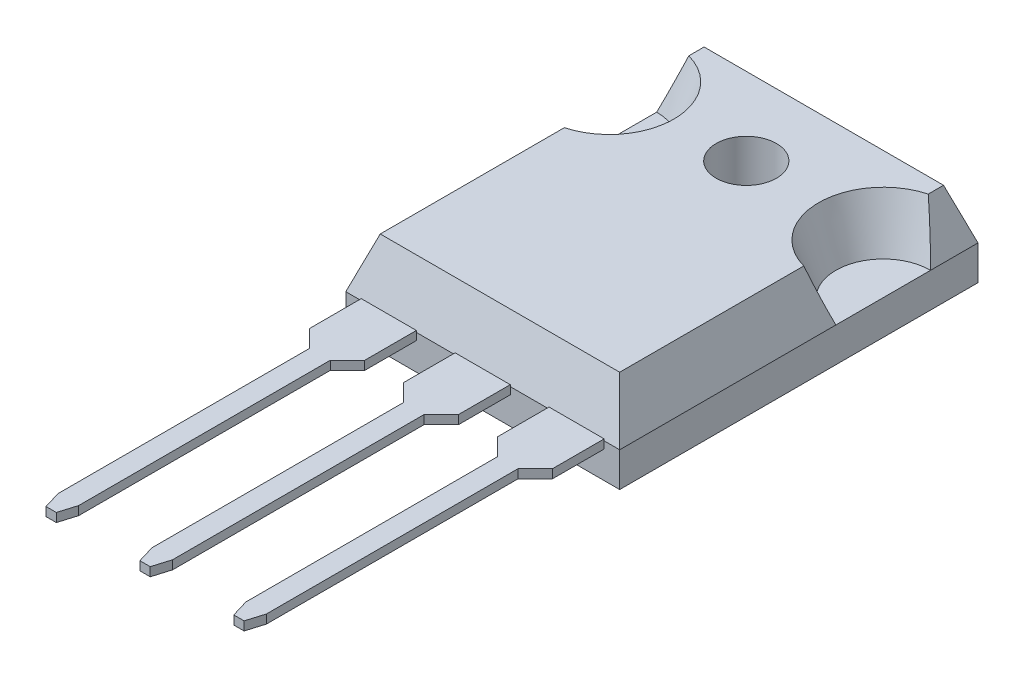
ISO-10303-21;
HEADER;
FILE_DESCRIPTION(('STEP AP214'),'2;1');
FILE_NAME('part.step','',(''),(''),'','','');
FILE_SCHEMA(('AUTOMOTIVE_DESIGN { 1 0 10303 214 1 1 1 1 }'));
ENDSEC;
DATA;
#1=APPLICATION_CONTEXT('core data for automotive mechanical design processes');
#2=APPLICATION_PROTOCOL_DEFINITION('international standard','automotive_design',2000,#1);
#3=PRODUCT_CONTEXT('',#1,'mechanical');
#4=PRODUCT('Part','Part','',(#3));
#5=PRODUCT_RELATED_PRODUCT_CATEGORY('part','',(#4));
#6=PRODUCT_DEFINITION_FORMATION('','',#4);
#7=PRODUCT_DEFINITION_CONTEXT('part definition',#1,'design');
#8=PRODUCT_DEFINITION('design','',#6,#7);
#9=PRODUCT_DEFINITION_SHAPE('','',#8);
#10=(LENGTH_UNIT() NAMED_UNIT(*) SI_UNIT(.MILLI.,.METRE.));
#11=(NAMED_UNIT(*) PLANE_ANGLE_UNIT() SI_UNIT($,.RADIAN.));
#12=(NAMED_UNIT(*) SI_UNIT($,.STERADIAN.) SOLID_ANGLE_UNIT());
#13=UNCERTAINTY_MEASURE_WITH_UNIT(LENGTH_MEASURE(1.E-05),#10,'distance_accuracy_value','');
#14=(GEOMETRIC_REPRESENTATION_CONTEXT(3) GLOBAL_UNCERTAINTY_ASSIGNED_CONTEXT((#13)) GLOBAL_UNIT_ASSIGNED_CONTEXT((#10,
#11,#12)) REPRESENTATION_CONTEXT('',''));
#15=CARTESIAN_POINT('',(0.,0.,0.));
#16=DIRECTION('',(0.,0.,1.));
#17=DIRECTION('',(1.,0.,0.));
#18=AXIS2_PLACEMENT_3D('',#15,#16,#17);
#19=CARTESIAN_POINT('',(-7.95,4.9,15.3));
#20=DIRECTION('',(0.,0.,-1.));
#21=DIRECTION('',(-1.,0.,0.));
#22=AXIS2_PLACEMENT_3D('',#19,#20,#21);
#23=PLANE('',#22);
#24=DIRECTION('',(0.,-1.,0.));
#25=VECTOR('',#24,1.);
#26=CARTESIAN_POINT('',(7.05,2.1,15.3));
#27=LINE('',#26,#25);
#28=CARTESIAN_POINT('',(7.05,1.99999999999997,15.3));
#29=VERTEX_POINT('',#28);
#30=CARTESIAN_POINT('',(7.05,1.59,15.3));
#31=VERTEX_POINT('',#30);
#32=EDGE_CURVE('E1404',#29,#31,#27,.T.);
#33=ORIENTED_EDGE('',*,*,#32,.T.);
#34=DIRECTION('',(-1.,0.,0.));
#35=VECTOR('',#34,1.);
#36=CARTESIAN_POINT('',(3.85,1.59,15.3));
#37=LINE('',#36,#35);
#38=CARTESIAN_POINT('',(3.85,1.59,15.3));
#39=VERTEX_POINT('',#38);
#40=EDGE_CURVE('E1435',#31,#39,#37,.T.);
#41=ORIENTED_EDGE('',*,*,#40,.T.);
#42=DIRECTION('',(0.,-1.,0.));
#43=VECTOR('',#42,1.);
#44=CARTESIAN_POINT('',(3.85,2.1,15.3));
#45=LINE('',#44,#43);
#46=CARTESIAN_POINT('',(3.85,1.99999999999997,15.3));
#47=VERTEX_POINT('',#46);
#48=EDGE_CURVE('E1421',#47,#39,#45,.T.);
#49=ORIENTED_EDGE('',*,*,#48,.F.);
#50=DIRECTION('',(-1.,0.,0.));
#51=VECTOR('',#50,1.);
#52=CARTESIAN_POINT('',(-7.95,1.99999999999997,15.3));
#53=LINE('',#52,#51);
#54=CARTESIAN_POINT('',(1.6,1.99999999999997,15.3));
#55=VERTEX_POINT('',#54);
#56=EDGE_CURVE('E923',#47,#55,#53,.T.);
#57=ORIENTED_EDGE('',*,*,#56,.T.);
#58=DIRECTION('',(0.,-1.,0.));
#59=VECTOR('',#58,1.);
#60=CARTESIAN_POINT('',(1.6,2.1,15.3));
#61=LINE('',#60,#59);
#62=CARTESIAN_POINT('',(1.6,1.59,15.3));
#63=VERTEX_POINT('',#62);
#64=EDGE_CURVE('E669',#55,#63,#61,.T.);
#65=ORIENTED_EDGE('',*,*,#64,.T.);
#66=DIRECTION('',(-1.,0.,0.));
#67=VECTOR('',#66,1.);
#68=CARTESIAN_POINT('',(-1.6,1.59,15.3));
#69=LINE('',#68,#67);
#70=CARTESIAN_POINT('',(-1.6,1.59,15.3));
#71=VERTEX_POINT('',#70);
#72=EDGE_CURVE('E617',#63,#71,#69,.T.);
#73=ORIENTED_EDGE('',*,*,#72,.T.);
#74=DIRECTION('',(0.,-1.,0.));
#75=VECTOR('',#74,1.);
#76=CARTESIAN_POINT('',(-1.6,2.1,15.3));
#77=LINE('',#76,#75);
#78=CARTESIAN_POINT('',(-1.6,1.99999999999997,15.3));
#79=VERTEX_POINT('',#78);
#80=EDGE_CURVE('E690',#79,#71,#77,.T.);
#81=ORIENTED_EDGE('',*,*,#80,.F.);
#82=CARTESIAN_POINT('',(-3.85,1.99999999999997,15.3));
#83=VERTEX_POINT('',#82);
#84=EDGE_CURVE('E1424',#79,#83,#53,.T.);
#85=ORIENTED_EDGE('',*,*,#84,.T.);
#86=DIRECTION('',(0.,-1.,0.));
#87=VECTOR('',#86,1.);
#88=CARTESIAN_POINT('',(-3.85,2.1,15.3));
#89=LINE('',#88,#87);
#90=CARTESIAN_POINT('',(-3.85,1.59,15.3));
#91=VERTEX_POINT('',#90);
#92=EDGE_CURVE('E573',#83,#91,#89,.T.);
#93=ORIENTED_EDGE('',*,*,#92,.T.);
#94=DIRECTION('',(-1.,0.,0.));
#95=VECTOR('',#94,1.);
#96=CARTESIAN_POINT('',(-7.05,1.59,15.3));
#97=LINE('',#96,#95);
#98=CARTESIAN_POINT('',(-7.05,1.59,15.3));
#99=VERTEX_POINT('',#98);
#100=EDGE_CURVE('E540',#91,#99,#97,.T.);
#101=ORIENTED_EDGE('',*,*,#100,.T.);
#102=DIRECTION('',(0.,-1.,0.));
#103=VECTOR('',#102,1.);
#104=CARTESIAN_POINT('',(-7.05,2.1,15.3));
#105=LINE('',#104,#103);
#106=CARTESIAN_POINT('',(-7.05,1.99999999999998,15.3));
#107=VERTEX_POINT('',#106);
#108=EDGE_CURVE('E612',#107,#99,#105,.T.);
#109=ORIENTED_EDGE('',*,*,#108,.F.);
#110=CARTESIAN_POINT('',(-7.95,1.99999999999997,15.3));
#111=VERTEX_POINT('',#110);
#112=EDGE_CURVE('E916',#107,#111,#53,.T.);
#113=ORIENTED_EDGE('',*,*,#112,.T.);
#114=DIRECTION('',(0.,-1.,0.));
#115=VECTOR('',#114,1.);
#116=CARTESIAN_POINT('',(-7.95,4.9,15.3));
#117=LINE('',#116,#115);
#118=CARTESIAN_POINT('',(-7.95,0.,15.3));
#119=VERTEX_POINT('',#118);
#120=EDGE_CURVE('E888',#111,#119,#117,.T.);
#121=ORIENTED_EDGE('',*,*,#120,.T.);
#122=DIRECTION('',(1.,0.,0.));
#123=VECTOR('',#122,1.);
#124=CARTESIAN_POINT('',(-7.95,0.,15.3));
#125=LINE('',#124,#123);
#126=CARTESIAN_POINT('',(7.95,0.,15.3));
#127=VERTEX_POINT('',#126);
#128=EDGE_CURVE('E867',#119,#127,#125,.T.);
#129=ORIENTED_EDGE('',*,*,#128,.T.);
#130=DIRECTION('',(0.,-1.,0.));
#131=VECTOR('',#130,1.);
#132=CARTESIAN_POINT('',(7.95,4.9,15.3));
#133=LINE('',#132,#131);
#134=CARTESIAN_POINT('',(7.95,1.99999999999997,15.3));
#135=VERTEX_POINT('',#134);
#136=EDGE_CURVE('E885',#135,#127,#133,.T.);
#137=ORIENTED_EDGE('',*,*,#136,.F.);
#138=EDGE_CURVE('E917',#135,#29,#53,.T.);
#139=ORIENTED_EDGE('',*,*,#138,.T.);
#140=EDGE_LOOP('',(#33,#41,#49,#57,#65,#73,#81,#85,#93,#101,#109,#113,#121,#129,#137,#139));
#141=FACE_BOUND('',#140,.T.);
#142=ADVANCED_FACE('F164',(#141),#23,.F.);
#143=CARTESIAN_POINT('',(-7.95,0.,15.3));
#144=DIRECTION('',(0.,-1.,0.));
#145=DIRECTION('',(0.,0.,-1.));
#146=AXIS2_PLACEMENT_3D('',#143,#144,#145);
#147=PLANE('',#146);
#148=CARTESIAN_POINT('',(0.,0.,0.));
#149=DIRECTION('',(0.,1.,0.));
#150=DIRECTION('',(0.,0.,1.));
#151=AXIS2_PLACEMENT_3D('',#148,#149,#150);
#152=CIRCLE('',#151,1.75);
#153=CARTESIAN_POINT('',(0.,0.,1.75));
#154=VERTEX_POINT('',#153);
#155=EDGE_CURVE('E855',#154,#154,#152,.T.);
#156=ORIENTED_EDGE('',*,*,#155,.T.);
#157=EDGE_LOOP('',(#156));
#158=FACE_BOUND('',#157,.T.);
#159=CARTESIAN_POINT('',(0.,0.,0.));
#160=DIRECTION('',(0.,-1.,0.));
#161=DIRECTION('',(0.,0.,-1.));
#162=AXIS2_PLACEMENT_3D('',#159,#160,#161);
#163=CIRCLE('',#162,3.35);
#164=CARTESIAN_POINT('',(0.,0.,-3.35));
#165=VERTEX_POINT('',#164);
#166=EDGE_CURVE('E696',#165,#165,#163,.T.);
#167=ORIENTED_EDGE('',*,*,#166,.T.);
#168=EDGE_LOOP('',(#167));
#169=FACE_BOUND('',#168,.T.);
#170=ADVANCED_FACE('F1031',(#158,#169),#147,.T.);
#171=CARTESIAN_POINT('',(0.,0.,0.));
#172=DIRECTION('',(0.,-1.,0.));
#173=DIRECTION('',(1.,0.,0.));
#174=AXIS2_PLACEMENT_3D('',#171,#172,#173);
#175=CIRCLE('',#174,3.55);
#176=CARTESIAN_POINT('',(3.55,0.,0.));
#177=VERTEX_POINT('',#176);
#178=EDGE_CURVE('E695',#177,#177,#175,.T.);
#179=ORIENTED_EDGE('',*,*,#178,.F.);
#180=EDGE_LOOP('',(#179));
#181=FACE_BOUND('',#180,.T.);
#182=CARTESIAN_POINT('',(6.,0.,-4.2));
#183=DIRECTION('',(0.,-1.,0.));
#184=DIRECTION('',(0.,0.,-1.));
#185=AXIS2_PLACEMENT_3D('',#182,#183,#184);
#186=CIRCLE('',#185,0.5);
#187=CARTESIAN_POINT('',(6.,0.,-4.7));
#188=VERTEX_POINT('',#187);
#189=CARTESIAN_POINT('',(6.5,0.,-4.2));
#190=VERTEX_POINT('',#189);
#191=EDGE_CURVE('E714',#188,#190,#186,.T.);
#192=ORIENTED_EDGE('',*,*,#191,.T.);
#193=DIRECTION('',(0.,0.,1.));
#194=VECTOR('',#193,1.);
#195=CARTESIAN_POINT('',(6.5,0.,-4.2));
#196=LINE('',#195,#194);
#197=CARTESIAN_POINT('',(6.5,0.,10.8));
#198=VERTEX_POINT('',#197);
#199=EDGE_CURVE('E705',#190,#198,#196,.T.);
#200=ORIENTED_EDGE('',*,*,#199,.T.);
#201=DIRECTION('',(-1.,0.,0.));
#202=VECTOR('',#201,1.);
#203=CARTESIAN_POINT('',(-6.5,0.,10.8));
#204=LINE('',#203,#202);
#205=CARTESIAN_POINT('',(-6.5,0.,10.8));
#206=VERTEX_POINT('',#205);
#207=EDGE_CURVE('E738',#198,#206,#204,.T.);
#208=ORIENTED_EDGE('',*,*,#207,.T.);
#209=DIRECTION('',(0.,0.,-1.));
#210=VECTOR('',#209,1.);
#211=CARTESIAN_POINT('',(-6.5,0.,-4.2));
#212=LINE('',#211,#210);
#213=CARTESIAN_POINT('',(-6.5,0.,-4.2));
#214=VERTEX_POINT('',#213);
#215=EDGE_CURVE('E742',#206,#214,#212,.T.);
#216=ORIENTED_EDGE('',*,*,#215,.T.);
#217=CARTESIAN_POINT('',(-6.,0.,-4.2));
#218=DIRECTION('',(0.,-1.,0.));
#219=DIRECTION('',(0.,0.,1.));
#220=AXIS2_PLACEMENT_3D('',#217,#218,#219);
#221=CIRCLE('',#220,0.5);
#222=CARTESIAN_POINT('',(-6.,0.,-4.7));
#223=VERTEX_POINT('',#222);
#224=EDGE_CURVE('E746',#214,#223,#221,.T.);
#225=ORIENTED_EDGE('',*,*,#224,.T.);
#226=DIRECTION('',(1.,0.,0.));
#227=VECTOR('',#226,1.);
#228=CARTESIAN_POINT('',(-6.,0.,-4.7));
#229=LINE('',#228,#227);
#230=EDGE_CURVE('E750',#223,#188,#229,.T.);
#231=ORIENTED_EDGE('',*,*,#230,.T.);
#232=EDGE_LOOP('',(#192,#200,#208,#216,#225,#231));
#233=FACE_BOUND('',#232,.T.);
#234=ADVANCED_FACE('F1037',(#181,#233),#147,.T.);
#235=DIRECTION('',(0.,0.,1.));
#236=VECTOR('',#235,1.);
#237=CARTESIAN_POINT('',(6.7,0.,-4.2));
#238=LINE('',#237,#236);
#239=CARTESIAN_POINT('',(6.7,0.,-4.2));
#240=VERTEX_POINT('',#239);
#241=CARTESIAN_POINT('',(6.7,0.,11.));
#242=VERTEX_POINT('',#241);
#243=EDGE_CURVE('E760',#240,#242,#238,.T.);
#244=ORIENTED_EDGE('',*,*,#243,.F.);
#245=CARTESIAN_POINT('',(6.,0.,-4.2));
#246=DIRECTION('',(0.,1.,0.));
#247=DIRECTION('',(-1.,0.,0.));
#248=AXIS2_PLACEMENT_3D('',#245,#246,#247);
#249=CIRCLE('',#248,0.7);
#250=CARTESIAN_POINT('',(6.,0.,-4.9));
#251=VERTEX_POINT('',#250);
#252=EDGE_CURVE('E781',#251,#240,#249,.F.);
#253=ORIENTED_EDGE('',*,*,#252,.F.);
#254=DIRECTION('',(1.,0.,0.));
#255=VECTOR('',#254,1.);
#256=CARTESIAN_POINT('',(-6.,0.,-4.9));
#257=LINE('',#256,#255);
#258=CARTESIAN_POINT('',(-6.,0.,-4.9));
#259=VERTEX_POINT('',#258);
#260=EDGE_CURVE('E816',#259,#251,#257,.T.);
#261=ORIENTED_EDGE('',*,*,#260,.F.);
#262=CARTESIAN_POINT('',(-6.,0.,-4.2));
#263=DIRECTION('',(0.,1.,0.));
#264=DIRECTION('',(-1.,0.,0.));
#265=AXIS2_PLACEMENT_3D('',#262,#263,#264);
#266=CIRCLE('',#265,0.7);
#267=CARTESIAN_POINT('',(-6.7,0.,-4.2));
#268=VERTEX_POINT('',#267);
#269=EDGE_CURVE('E812',#268,#259,#266,.F.);
#270=ORIENTED_EDGE('',*,*,#269,.F.);
#271=DIRECTION('',(0.,0.,-1.));
#272=VECTOR('',#271,1.);
#273=CARTESIAN_POINT('',(-6.7,0.,-4.2));
#274=LINE('',#273,#272);
#275=CARTESIAN_POINT('',(-6.7,0.,11.));
#276=VERTEX_POINT('',#275);
#277=EDGE_CURVE('E808',#276,#268,#274,.T.);
#278=ORIENTED_EDGE('',*,*,#277,.F.);
#279=DIRECTION('',(-1.,0.,0.));
#280=VECTOR('',#279,1.);
#281=CARTESIAN_POINT('',(-6.,0.,11.));
#282=LINE('',#281,#280);
#283=EDGE_CURVE('E804',#242,#276,#282,.T.);
#284=ORIENTED_EDGE('',*,*,#283,.F.);
#285=EDGE_LOOP('',(#244,#253,#261,#270,#278,#284));
#286=FACE_BOUND('',#285,.T.);
#287=DIRECTION('',(0.,0.,1.));
#288=VECTOR('',#287,1.);
#289=CARTESIAN_POINT('',(-7.95,0.,15.3));
#290=LINE('',#289,#288);
#291=CARTESIAN_POINT('',(-7.95,0.,-5.5));
#292=VERTEX_POINT('',#291);
#293=EDGE_CURVE('E863',#292,#119,#290,.T.);
#294=ORIENTED_EDGE('',*,*,#293,.F.);
#295=DIRECTION('',(-1.,0.,0.));
#296=VECTOR('',#295,1.);
#297=CARTESIAN_POINT('',(-7.95,0.,-5.5));
#298=LINE('',#297,#296);
#299=CARTESIAN_POINT('',(7.95,0.,-5.5));
#300=VERTEX_POINT('',#299);
#301=EDGE_CURVE('E875',#300,#292,#298,.T.);
#302=ORIENTED_EDGE('',*,*,#301,.F.);
#303=DIRECTION('',(0.,0.,-1.));
#304=VECTOR('',#303,1.);
#305=CARTESIAN_POINT('',(7.95,0.,15.3));
#306=LINE('',#305,#304);
#307=EDGE_CURVE('E871',#127,#300,#306,.T.);
#308=ORIENTED_EDGE('',*,*,#307,.F.);
#309=ORIENTED_EDGE('',*,*,#128,.F.);
#310=EDGE_LOOP('',(#294,#302,#308,#309));
#311=FACE_BOUND('',#310,.T.);
#312=ADVANCED_FACE('F1040',(#286,#311),#147,.T.);
#313=CARTESIAN_POINT('',(-7.95,4.9,15.3));
#314=DIRECTION('',(1.,0.,0.));
#315=DIRECTION('',(0.,0.,-1.));
#316=AXIS2_PLACEMENT_3D('',#313,#314,#315);
#317=PLANE('',#316);
#318=DIRECTION('',(0.,0.,1.));
#319=VECTOR('',#318,1.);
#320=CARTESIAN_POINT('',(-7.95,2.,2.75));
#321=LINE('',#320,#319);
#322=CARTESIAN_POINT('',(-7.95,2.,-2.75));
#323=VERTEX_POINT('',#322);
#324=CARTESIAN_POINT('',(-7.95,2.,2.75));
#325=VERTEX_POINT('',#324);
#326=EDGE_CURVE('E848',#323,#325,#321,.T.);
#327=ORIENTED_EDGE('',*,*,#326,.F.);
#328=DIRECTION('',(0.,0.,-1.));
#329=VECTOR('',#328,1.);
#330=CARTESIAN_POINT('',(-7.95,1.99999999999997,15.3));
#331=LINE('',#330,#329);
#332=CARTESIAN_POINT('',(-7.95,1.99999999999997,-5.5));
#333=VERTEX_POINT('',#332);
#334=EDGE_CURVE('E936',#323,#333,#331,.T.);
#335=ORIENTED_EDGE('',*,*,#334,.T.);
#336=DIRECTION('',(0.,-1.,0.));
#337=VECTOR('',#336,1.);
#338=CARTESIAN_POINT('',(-7.95,4.9,-5.5));
#339=LINE('',#338,#337);
#340=EDGE_CURVE('E879',#333,#292,#339,.T.);
#341=ORIENTED_EDGE('',*,*,#340,.T.);
#342=ORIENTED_EDGE('',*,*,#293,.T.);
#343=ORIENTED_EDGE('',*,*,#120,.F.);
#344=DIRECTION('',(0.,0.,-1.));
#345=VECTOR('',#344,1.);
#346=CARTESIAN_POINT('',(-7.95,1.99999999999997,15.3));
#347=LINE('',#346,#345);
#348=EDGE_CURVE('E933',#111,#325,#347,.T.);
#349=ORIENTED_EDGE('',*,*,#348,.T.);
#350=EDGE_LOOP('',(#327,#335,#341,#342,#343,#349));
#351=FACE_BOUND('',#350,.T.);
#352=ADVANCED_FACE('F1045',(#351),#317,.F.);
#353=CARTESIAN_POINT('',(7.95,4.9,15.3));
#354=DIRECTION('',(-1.,0.,0.));
#355=DIRECTION('',(0.,0.,1.));
#356=AXIS2_PLACEMENT_3D('',#353,#354,#355);
#357=PLANE('',#356);
#358=DIRECTION('',(0.,0.,-1.));
#359=VECTOR('',#358,1.);
#360=CARTESIAN_POINT('',(7.95,2.,2.75));
#361=LINE('',#360,#359);
#362=CARTESIAN_POINT('',(7.95,2.,2.75));
#363=VERTEX_POINT('',#362);
#364=CARTESIAN_POINT('',(7.95,2.,-2.75));
#365=VERTEX_POINT('',#364);
#366=EDGE_CURVE('E826',#363,#365,#361,.T.);
#367=ORIENTED_EDGE('',*,*,#366,.F.);
#368=DIRECTION('',(0.,0.,1.));
#369=VECTOR('',#368,1.);
#370=CARTESIAN_POINT('',(7.95,1.99999999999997,15.3));
#371=LINE('',#370,#369);
#372=EDGE_CURVE('E927',#363,#135,#371,.T.);
#373=ORIENTED_EDGE('',*,*,#372,.T.);
#374=ORIENTED_EDGE('',*,*,#136,.T.);
#375=ORIENTED_EDGE('',*,*,#307,.T.);
#376=DIRECTION('',(0.,-1.,0.));
#377=VECTOR('',#376,1.);
#378=CARTESIAN_POINT('',(7.95,4.9,-5.5));
#379=LINE('',#378,#377);
#380=CARTESIAN_POINT('',(7.95,1.99999999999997,-5.5));
#381=VERTEX_POINT('',#380);
#382=EDGE_CURVE('E882',#381,#300,#379,.T.);
#383=ORIENTED_EDGE('',*,*,#382,.F.);
#384=DIRECTION('',(0.,0.,1.));
#385=VECTOR('',#384,1.);
#386=CARTESIAN_POINT('',(7.95,1.99999999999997,15.3));
#387=LINE('',#386,#385);
#388=EDGE_CURVE('E921',#381,#365,#387,.T.);
#389=ORIENTED_EDGE('',*,*,#388,.T.);
#390=EDGE_LOOP('',(#367,#373,#374,#375,#383,#389));
#391=FACE_BOUND('',#390,.T.);
#392=ADVANCED_FACE('F1043',(#391),#357,.F.);
#393=CARTESIAN_POINT('',(-7.95,4.9,-5.5));
#394=DIRECTION('',(0.,0.,1.));
#395=DIRECTION('',(1.,0.,0.));
#396=AXIS2_PLACEMENT_3D('',#393,#394,#395);
#397=PLANE('',#396);
#398=ORIENTED_EDGE('',*,*,#340,.F.);
#399=DIRECTION('',(1.,0.,0.));
#400=VECTOR('',#399,1.);
#401=CARTESIAN_POINT('',(-7.95,1.99999999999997,-5.5));
#402=LINE('',#401,#400);
#403=EDGE_CURVE('E930',#333,#381,#402,.T.);
#404=ORIENTED_EDGE('',*,*,#403,.T.);
#405=ORIENTED_EDGE('',*,*,#382,.T.);
#406=ORIENTED_EDGE('',*,*,#301,.T.);
#407=EDGE_LOOP('',(#398,#404,#405,#406));
#408=FACE_BOUND('',#407,.T.);
#409=ADVANCED_FACE('F1109',(#408),#397,.F.);
#410=CARTESIAN_POINT('',(-7.95,4.9,15.3));
#411=DIRECTION('',(0.,-1.,0.));
#412=DIRECTION('',(0.,0.,-1.));
#413=AXIS2_PLACEMENT_3D('',#410,#411,#412);
#414=PLANE('',#413);
#415=DIRECTION('',(0.,0.,1.));
#416=VECTOR('',#415,1.);
#417=CARTESIAN_POINT('',(-6.95,4.9,15.3));
#418=LINE('',#417,#416);
#419=CARTESIAN_POINT('',(-6.95,4.9,3.61420807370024));
#420=VERTEX_POINT('',#419);
#421=CARTESIAN_POINT('',(-6.95,4.9,14.3));
#422=VERTEX_POINT('',#421);
#423=EDGE_CURVE('E891',#420,#422,#418,.T.);
#424=ORIENTED_EDGE('',*,*,#423,.T.);
#425=DIRECTION('',(1.,0.,0.));
#426=VECTOR('',#425,1.);
#427=CARTESIAN_POINT('',(-7.95,4.9,14.3));
#428=LINE('',#427,#426);
#429=CARTESIAN_POINT('',(6.95,4.9,14.3));
#430=VERTEX_POINT('',#429);
#431=EDGE_CURVE('E912',#422,#430,#428,.T.);
#432=ORIENTED_EDGE('',*,*,#431,.T.);
#433=DIRECTION('',(0.,0.,-1.));
#434=VECTOR('',#433,1.);
#435=CARTESIAN_POINT('',(6.95,4.9,15.3));
#436=LINE('',#435,#434);
#437=CARTESIAN_POINT('',(6.95,4.9,3.61420807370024));
#438=VERTEX_POINT('',#437);
#439=EDGE_CURVE('E909',#430,#438,#436,.T.);
#440=ORIENTED_EDGE('',*,*,#439,.T.);
#441=CARTESIAN_POINT('',(7.95,4.9,0.));
#442=DIRECTION('',(0.,-1.,0.));
#443=DIRECTION('',(0.,0.,-1.));
#444=AXIS2_PLACEMENT_3D('',#441,#442,#443);
#445=CIRCLE('',#444,3.75);
#446=CARTESIAN_POINT('',(6.95,4.9,-3.61420807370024));
#447=VERTEX_POINT('',#446);
#448=EDGE_CURVE('E906',#438,#447,#445,.T.);
#449=ORIENTED_EDGE('',*,*,#448,.T.);
#450=DIRECTION('',(0.,0.,-1.));
#451=VECTOR('',#450,1.);
#452=CARTESIAN_POINT('',(6.95,4.9,15.3));
#453=LINE('',#452,#451);
#454=CARTESIAN_POINT('',(6.95,4.9,-4.5));
#455=VERTEX_POINT('',#454);
#456=EDGE_CURVE('E903',#447,#455,#453,.T.);
#457=ORIENTED_EDGE('',*,*,#456,.T.);
#458=DIRECTION('',(-1.,0.,0.));
#459=VECTOR('',#458,1.);
#460=CARTESIAN_POINT('',(-7.95,4.9,-4.5));
#461=LINE('',#460,#459);
#462=CARTESIAN_POINT('',(-6.95,4.9,-4.5));
#463=VERTEX_POINT('',#462);
#464=EDGE_CURVE('E900',#455,#463,#461,.T.);
#465=ORIENTED_EDGE('',*,*,#464,.T.);
#466=DIRECTION('',(0.,0.,1.));
#467=VECTOR('',#466,1.);
#468=CARTESIAN_POINT('',(-6.95,4.9,15.3));
#469=LINE('',#468,#467);
#470=CARTESIAN_POINT('',(-6.95,4.9,-3.61420807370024));
#471=VERTEX_POINT('',#470);
#472=EDGE_CURVE('E897',#463,#471,#469,.T.);
#473=ORIENTED_EDGE('',*,*,#472,.T.);
#474=CARTESIAN_POINT('',(-7.95,4.9,0.));
#475=DIRECTION('',(0.,-1.,0.));
#476=DIRECTION('',(0.,0.,-1.));
#477=AXIS2_PLACEMENT_3D('',#474,#475,#476);
#478=CIRCLE('',#477,3.75);
#479=EDGE_CURVE('E894',#471,#420,#478,.T.);
#480=ORIENTED_EDGE('',*,*,#479,.T.);
#481=EDGE_LOOP('',(#424,#432,#440,#449,#457,#465,#473,#480));
#482=FACE_BOUND('',#481,.T.);
#483=CARTESIAN_POINT('',(0.,4.9,0.));
#484=DIRECTION('',(0.,1.,0.));
#485=DIRECTION('',(0.,0.,1.));
#486=AXIS2_PLACEMENT_3D('',#483,#484,#485);
#487=CIRCLE('',#486,1.75);
#488=CARTESIAN_POINT('',(0.,4.9,1.75));
#489=VERTEX_POINT('',#488);
#490=EDGE_CURVE('E859',#489,#489,#487,.T.);
#491=ORIENTED_EDGE('',*,*,#490,.F.);
#492=EDGE_LOOP('',(#491));
#493=FACE_BOUND('',#492,.T.);
#494=ADVANCED_FACE('F1085',(#482,#493),#414,.F.);
#495=CARTESIAN_POINT('',(0.,4.9,0.));
#496=DIRECTION('',(0.,1.,0.));
#497=DIRECTION('',(0.,0.,1.));
#498=AXIS2_PLACEMENT_3D('',#495,#496,#497);
#499=CYLINDRICAL_SURFACE('',#498,1.75);
#500=ORIENTED_EDGE('',*,*,#155,.F.);
#501=EDGE_LOOP('',(#500));
#502=FACE_BOUND('',#501,.T.);
#503=ORIENTED_EDGE('',*,*,#490,.T.);
#504=EDGE_LOOP('',(#503));
#505=FACE_BOUND('',#504,.T.);
#506=ADVANCED_FACE('F1115',(#502,#505),#499,.F.);
#507=CARTESIAN_POINT('',(-7.95,2.,15.3));
#508=DIRECTION('',(0.,-1.,0.));
#509=DIRECTION('',(0.,0.,-1.));
#510=AXIS2_PLACEMENT_3D('',#507,#508,#509);
#511=PLANE('',#510);
#512=CARTESIAN_POINT('',(-7.95,2.,0.));
#513=DIRECTION('',(0.,-1.,0.));
#514=DIRECTION('',(0.,0.,-1.));
#515=AXIS2_PLACEMENT_3D('',#512,#513,#514);
#516=CIRCLE('',#515,2.75);
#517=EDGE_CURVE('E852',#325,#323,#516,.F.);
#518=ORIENTED_EDGE('',*,*,#517,.T.);
#519=ORIENTED_EDGE('',*,*,#326,.T.);
#520=EDGE_LOOP('',(#518,#519));
#521=FACE_BOUND('',#520,.T.);
#522=ADVANCED_FACE('F1122',(#521),#511,.F.);
#523=CARTESIAN_POINT('',(-7.95,2.,15.3));
#524=DIRECTION('',(0.,-1.,0.));
#525=DIRECTION('',(0.,0.,-1.));
#526=AXIS2_PLACEMENT_3D('',#523,#524,#525);
#527=PLANE('',#526);
#528=CARTESIAN_POINT('',(7.95,2.,0.));
#529=DIRECTION('',(0.,-1.,0.));
#530=DIRECTION('',(0.,0.,-1.));
#531=AXIS2_PLACEMENT_3D('',#528,#529,#530);
#532=CIRCLE('',#531,2.75);
#533=EDGE_CURVE('E845',#365,#363,#532,.F.);
#534=ORIENTED_EDGE('',*,*,#533,.T.);
#535=ORIENTED_EDGE('',*,*,#366,.T.);
#536=EDGE_LOOP('',(#534,#535));
#537=FACE_BOUND('',#536,.T.);
#538=ADVANCED_FACE('F1126',(#537),#527,.F.);
#539=CARTESIAN_POINT('',(6.7,0.2,-4.2));
#540=DIRECTION('',(1.,0.,0.));
#541=DIRECTION('',(0.,0.,-1.));
#542=AXIS2_PLACEMENT_3D('',#539,#540,#541);
#543=PLANE('',#542);
#544=ORIENTED_EDGE('',*,*,#243,.T.);
#545=DIRECTION('',(0.,-1.,0.));
#546=VECTOR('',#545,1.);
#547=CARTESIAN_POINT('',(6.7,0.2,11.));
#548=LINE('',#547,#546);
#549=CARTESIAN_POINT('',(6.7,0.2,11.));
#550=VERTEX_POINT('',#549);
#551=EDGE_CURVE('E801',#550,#242,#548,.T.);
#552=ORIENTED_EDGE('',*,*,#551,.F.);
#553=DIRECTION('',(0.,0.,1.));
#554=VECTOR('',#553,1.);
#555=CARTESIAN_POINT('',(6.7,0.2,-4.2));
#556=LINE('',#555,#554);
#557=CARTESIAN_POINT('',(6.7,0.2,-4.2));
#558=VERTEX_POINT('',#557);
#559=EDGE_CURVE('E776',#558,#550,#556,.T.);
#560=ORIENTED_EDGE('',*,*,#559,.F.);
#561=DIRECTION('',(0.,-1.,0.));
#562=VECTOR('',#561,1.);
#563=CARTESIAN_POINT('',(6.7,0.2,-4.2));
#564=LINE('',#563,#562);
#565=EDGE_CURVE('E823',#558,#240,#564,.T.);
#566=ORIENTED_EDGE('',*,*,#565,.T.);
#567=EDGE_LOOP('',(#544,#552,#560,#566));
#568=FACE_BOUND('',#567,.T.);
#569=ADVANCED_FACE('F1130',(#568),#543,.F.);
#570=CARTESIAN_POINT('',(6.,0.2,-4.2));
#571=DIRECTION('',(0.,-1.,0.));
#572=DIRECTION('',(0.,0.,-1.));
#573=AXIS2_PLACEMENT_3D('',#570,#571,#572);
#574=CYLINDRICAL_SURFACE('',#573,0.7);
#575=ORIENTED_EDGE('',*,*,#252,.T.);
#576=ORIENTED_EDGE('',*,*,#565,.F.);
#577=CARTESIAN_POINT('',(6.,0.2,-4.2));
#578=DIRECTION('',(0.,1.,0.));
#579=DIRECTION('',(-1.,0.,0.));
#580=AXIS2_PLACEMENT_3D('',#577,#578,#579);
#581=CIRCLE('',#580,0.7);
#582=CARTESIAN_POINT('',(6.,0.2,-4.9));
#583=VERTEX_POINT('',#582);
#584=EDGE_CURVE('E797',#583,#558,#581,.F.);
#585=ORIENTED_EDGE('',*,*,#584,.F.);
#586=DIRECTION('',(0.,-1.,0.));
#587=VECTOR('',#586,1.);
#588=CARTESIAN_POINT('',(6.,0.2,-4.9));
#589=LINE('',#588,#587);
#590=EDGE_CURVE('E827',#583,#251,#589,.T.);
#591=ORIENTED_EDGE('',*,*,#590,.T.);
#592=EDGE_LOOP('',(#575,#576,#585,#591));
#593=FACE_BOUND('',#592,.T.);
#594=ADVANCED_FACE('F1134',(#593),#574,.F.);
#595=CARTESIAN_POINT('',(-6.,0.2,-4.9));
#596=DIRECTION('',(0.,0.,-1.));
#597=DIRECTION('',(-1.,0.,0.));
#598=AXIS2_PLACEMENT_3D('',#595,#596,#597);
#599=PLANE('',#598);
#600=ORIENTED_EDGE('',*,*,#260,.T.);
#601=ORIENTED_EDGE('',*,*,#590,.F.);
#602=DIRECTION('',(1.,0.,0.));
#603=VECTOR('',#602,1.);
#604=CARTESIAN_POINT('',(-6.,0.2,-4.9));
#605=LINE('',#604,#603);
#606=CARTESIAN_POINT('',(-6.,0.2,-4.9));
#607=VERTEX_POINT('',#606);
#608=EDGE_CURVE('E793',#607,#583,#605,.T.);
#609=ORIENTED_EDGE('',*,*,#608,.F.);
#610=DIRECTION('',(0.,-1.,0.));
#611=VECTOR('',#610,1.);
#612=CARTESIAN_POINT('',(-6.,0.2,-4.9));
#613=LINE('',#612,#611);
#614=EDGE_CURVE('E830',#607,#259,#613,.T.);
#615=ORIENTED_EDGE('',*,*,#614,.T.);
#616=EDGE_LOOP('',(#600,#601,#609,#615));
#617=FACE_BOUND('',#616,.T.);
#618=ADVANCED_FACE('F1148',(#617),#599,.F.);
#619=CARTESIAN_POINT('',(-6.,0.2,-4.2));
#620=DIRECTION('',(0.,-1.,0.));
#621=DIRECTION('',(0.,0.,-1.));
#622=AXIS2_PLACEMENT_3D('',#619,#620,#621);
#623=CYLINDRICAL_SURFACE('',#622,0.7);
#624=ORIENTED_EDGE('',*,*,#269,.T.);
#625=ORIENTED_EDGE('',*,*,#614,.F.);
#626=CARTESIAN_POINT('',(-6.,0.2,-4.2));
#627=DIRECTION('',(0.,1.,0.));
#628=DIRECTION('',(-1.,0.,0.));
#629=AXIS2_PLACEMENT_3D('',#626,#627,#628);
#630=CIRCLE('',#629,0.7);
#631=CARTESIAN_POINT('',(-6.7,0.2,-4.2));
#632=VERTEX_POINT('',#631);
#633=EDGE_CURVE('E789',#632,#607,#630,.F.);
#634=ORIENTED_EDGE('',*,*,#633,.F.);
#635=DIRECTION('',(0.,-1.,0.));
#636=VECTOR('',#635,1.);
#637=CARTESIAN_POINT('',(-6.7,0.2,-4.2));
#638=LINE('',#637,#636);
#639=EDGE_CURVE('E833',#632,#268,#638,.T.);
#640=ORIENTED_EDGE('',*,*,#639,.T.);
#641=EDGE_LOOP('',(#624,#625,#634,#640));
#642=FACE_BOUND('',#641,.T.);
#643=ADVANCED_FACE('F1144',(#642),#623,.F.);
#644=CARTESIAN_POINT('',(-6.7,0.2,-4.2));
#645=DIRECTION('',(-1.,0.,0.));
#646=DIRECTION('',(0.,0.,1.));
#647=AXIS2_PLACEMENT_3D('',#644,#645,#646);
#648=PLANE('',#647);
#649=ORIENTED_EDGE('',*,*,#277,.T.);
#650=ORIENTED_EDGE('',*,*,#639,.F.);
#651=DIRECTION('',(0.,0.,-1.));
#652=VECTOR('',#651,1.);
#653=CARTESIAN_POINT('',(-6.7,0.2,-4.2));
#654=LINE('',#653,#652);
#655=CARTESIAN_POINT('',(-6.7,0.2,11.));
#656=VERTEX_POINT('',#655);
#657=EDGE_CURVE('E785',#656,#632,#654,.T.);
#658=ORIENTED_EDGE('',*,*,#657,.F.);
#659=DIRECTION('',(0.,-1.,0.));
#660=VECTOR('',#659,1.);
#661=CARTESIAN_POINT('',(-6.7,0.2,11.));
#662=LINE('',#661,#660);
#663=EDGE_CURVE('E836',#656,#276,#662,.T.);
#664=ORIENTED_EDGE('',*,*,#663,.T.);
#665=EDGE_LOOP('',(#649,#650,#658,#664));
#666=FACE_BOUND('',#665,.T.);
#667=ADVANCED_FACE('F1140',(#666),#648,.F.);
#668=CARTESIAN_POINT('',(-6.,0.2,11.));
#669=DIRECTION('',(0.,0.,1.));
#670=DIRECTION('',(1.,0.,0.));
#671=AXIS2_PLACEMENT_3D('',#668,#669,#670);
#672=PLANE('',#671);
#673=ORIENTED_EDGE('',*,*,#283,.T.);
#674=ORIENTED_EDGE('',*,*,#663,.F.);
#675=DIRECTION('',(-1.,0.,0.));
#676=VECTOR('',#675,1.);
#677=CARTESIAN_POINT('',(-6.,0.2,11.));
#678=LINE('',#677,#676);
#679=EDGE_CURVE('E780',#550,#656,#678,.T.);
#680=ORIENTED_EDGE('',*,*,#679,.F.);
#681=ORIENTED_EDGE('',*,*,#551,.T.);
#682=EDGE_LOOP('',(#673,#674,#680,#681));
#683=FACE_BOUND('',#682,.T.);
#684=ADVANCED_FACE('F1136',(#683),#672,.F.);
#685=CARTESIAN_POINT('',(-6.,0.2,-4.2));
#686=DIRECTION('',(0.,1.,0.));
#687=DIRECTION('',(0.,0.,1.));
#688=AXIS2_PLACEMENT_3D('',#685,#686,#687);
#689=PLANE('',#688);
#690=DIRECTION('',(0.,0.,1.));
#691=VECTOR('',#690,1.);
#692=CARTESIAN_POINT('',(6.5,0.2,-4.2));
#693=LINE('',#692,#691);
#694=CARTESIAN_POINT('',(6.5,0.2,-4.2));
#695=VERTEX_POINT('',#694);
#696=CARTESIAN_POINT('',(6.5,0.2,10.8));
#697=VERTEX_POINT('',#696);
#698=EDGE_CURVE('E709',#695,#697,#693,.T.);
#699=ORIENTED_EDGE('',*,*,#698,.F.);
#700=CARTESIAN_POINT('',(6.,0.2,-4.2));
#701=DIRECTION('',(0.,-1.,0.));
#702=DIRECTION('',(0.,0.,-1.));
#703=AXIS2_PLACEMENT_3D('',#700,#701,#702);
#704=CIRCLE('',#703,0.5);
#705=CARTESIAN_POINT('',(6.,0.2,-4.7));
#706=VERTEX_POINT('',#705);
#707=EDGE_CURVE('E730',#706,#695,#704,.T.);
#708=ORIENTED_EDGE('',*,*,#707,.F.);
#709=DIRECTION('',(1.,0.,0.));
#710=VECTOR('',#709,1.);
#711=CARTESIAN_POINT('',(-6.,0.2,-4.7));
#712=LINE('',#711,#710);
#713=CARTESIAN_POINT('',(-6.,0.2,-4.7));
#714=VERTEX_POINT('',#713);
#715=EDGE_CURVE('E726',#714,#706,#712,.T.);
#716=ORIENTED_EDGE('',*,*,#715,.F.);
#717=CARTESIAN_POINT('',(-6.,0.2,-4.2));
#718=DIRECTION('',(0.,-1.,0.));
#719=DIRECTION('',(0.,0.,1.));
#720=AXIS2_PLACEMENT_3D('',#717,#718,#719);
#721=CIRCLE('',#720,0.5);
#722=CARTESIAN_POINT('',(-6.5,0.2,-4.2));
#723=VERTEX_POINT('',#722);
#724=EDGE_CURVE('E722',#723,#714,#721,.T.);
#725=ORIENTED_EDGE('',*,*,#724,.F.);
#726=DIRECTION('',(0.,0.,-1.));
#727=VECTOR('',#726,1.);
#728=CARTESIAN_POINT('',(-6.5,0.2,-4.2));
#729=LINE('',#728,#727);
#730=CARTESIAN_POINT('',(-6.5,0.2,10.8));
#731=VERTEX_POINT('',#730);
#732=EDGE_CURVE('E718',#731,#723,#729,.T.);
#733=ORIENTED_EDGE('',*,*,#732,.F.);
#734=DIRECTION('',(-1.,0.,0.));
#735=VECTOR('',#734,1.);
#736=CARTESIAN_POINT('',(-6.5,0.2,10.8));
#737=LINE('',#736,#735);
#738=EDGE_CURVE('E713',#697,#731,#737,.T.);
#739=ORIENTED_EDGE('',*,*,#738,.F.);
#740=EDGE_LOOP('',(#699,#708,#716,#725,#733,#739));
#741=FACE_BOUND('',#740,.T.);
#742=ORIENTED_EDGE('',*,*,#559,.T.);
#743=ORIENTED_EDGE('',*,*,#679,.T.);
#744=ORIENTED_EDGE('',*,*,#657,.T.);
#745=ORIENTED_EDGE('',*,*,#633,.T.);
#746=ORIENTED_EDGE('',*,*,#608,.T.);
#747=ORIENTED_EDGE('',*,*,#584,.T.);
#748=EDGE_LOOP('',(#742,#743,#744,#745,#746,#747));
#749=FACE_BOUND('',#748,.T.);
#750=ADVANCED_FACE('F1139',(#741,#749),#689,.F.);
#751=CARTESIAN_POINT('',(6.5,0.2,-4.2));
#752=DIRECTION('',(1.,0.,0.));
#753=DIRECTION('',(0.,0.,-1.));
#754=AXIS2_PLACEMENT_3D('',#751,#752,#753);
#755=PLANE('',#754);
#756=ORIENTED_EDGE('',*,*,#199,.F.);
#757=DIRECTION('',(0.,-1.,0.));
#758=VECTOR('',#757,1.);
#759=CARTESIAN_POINT('',(6.5,0.2,-4.2));
#760=LINE('',#759,#758);
#761=EDGE_CURVE('E757',#695,#190,#760,.T.);
#762=ORIENTED_EDGE('',*,*,#761,.F.);
#763=ORIENTED_EDGE('',*,*,#698,.T.);
#764=DIRECTION('',(0.,-1.,0.));
#765=VECTOR('',#764,1.);
#766=CARTESIAN_POINT('',(6.5,0.2,10.8));
#767=LINE('',#766,#765);
#768=EDGE_CURVE('E734',#697,#198,#767,.T.);
#769=ORIENTED_EDGE('',*,*,#768,.T.);
#770=EDGE_LOOP('',(#756,#762,#763,#769));
#771=FACE_BOUND('',#770,.T.);
#772=ADVANCED_FACE('F1158',(#771),#755,.T.);
#773=CARTESIAN_POINT('',(6.,0.2,-4.2));
#774=DIRECTION('',(0.,-1.,0.));
#775=DIRECTION('',(0.,0.,-1.));
#776=AXIS2_PLACEMENT_3D('',#773,#774,#775);
#777=CYLINDRICAL_SURFACE('',#776,0.5);
#778=ORIENTED_EDGE('',*,*,#191,.F.);
#779=DIRECTION('',(0.,-1.,0.));
#780=VECTOR('',#779,1.);
#781=CARTESIAN_POINT('',(6.,0.2,-4.7));
#782=LINE('',#781,#780);
#783=EDGE_CURVE('E761',#706,#188,#782,.T.);
#784=ORIENTED_EDGE('',*,*,#783,.F.);
#785=ORIENTED_EDGE('',*,*,#707,.T.);
#786=ORIENTED_EDGE('',*,*,#761,.T.);
#787=EDGE_LOOP('',(#778,#784,#785,#786));
#788=FACE_BOUND('',#787,.T.);
#789=ADVANCED_FACE('F1162',(#788),#777,.T.);
#790=CARTESIAN_POINT('',(-6.,0.2,-4.7));
#791=DIRECTION('',(0.,0.,-1.));
#792=DIRECTION('',(-1.,0.,0.));
#793=AXIS2_PLACEMENT_3D('',#790,#791,#792);
#794=PLANE('',#793);
#795=ORIENTED_EDGE('',*,*,#230,.F.);
#796=DIRECTION('',(0.,-1.,0.));
#797=VECTOR('',#796,1.);
#798=CARTESIAN_POINT('',(-6.,0.2,-4.7));
#799=LINE('',#798,#797);
#800=EDGE_CURVE('E764',#714,#223,#799,.T.);
#801=ORIENTED_EDGE('',*,*,#800,.F.);
#802=ORIENTED_EDGE('',*,*,#715,.T.);
#803=ORIENTED_EDGE('',*,*,#783,.T.);
#804=EDGE_LOOP('',(#795,#801,#802,#803));
#805=FACE_BOUND('',#804,.T.);
#806=ADVANCED_FACE('F1176',(#805),#794,.T.);
#807=CARTESIAN_POINT('',(-6.,0.2,-4.2));
#808=DIRECTION('',(0.,-1.,0.));
#809=DIRECTION('',(0.,0.,-1.));
#810=AXIS2_PLACEMENT_3D('',#807,#808,#809);
#811=CYLINDRICAL_SURFACE('',#810,0.5);
#812=ORIENTED_EDGE('',*,*,#224,.F.);
#813=DIRECTION('',(0.,-1.,0.));
#814=VECTOR('',#813,1.);
#815=CARTESIAN_POINT('',(-6.5,0.2,-4.2));
#816=LINE('',#815,#814);
#817=EDGE_CURVE('E767',#723,#214,#816,.T.);
#818=ORIENTED_EDGE('',*,*,#817,.F.);
#819=ORIENTED_EDGE('',*,*,#724,.T.);
#820=ORIENTED_EDGE('',*,*,#800,.T.);
#821=EDGE_LOOP('',(#812,#818,#819,#820));
#822=FACE_BOUND('',#821,.T.);
#823=ADVANCED_FACE('F1172',(#822),#811,.T.);
#824=CARTESIAN_POINT('',(-6.5,0.2,-4.2));
#825=DIRECTION('',(-1.,0.,0.));
#826=DIRECTION('',(0.,0.,1.));
#827=AXIS2_PLACEMENT_3D('',#824,#825,#826);
#828=PLANE('',#827);
#829=ORIENTED_EDGE('',*,*,#215,.F.);
#830=DIRECTION('',(0.,-1.,0.));
#831=VECTOR('',#830,1.);
#832=CARTESIAN_POINT('',(-6.5,0.2,10.8));
#833=LINE('',#832,#831);
#834=EDGE_CURVE('E770',#731,#206,#833,.T.);
#835=ORIENTED_EDGE('',*,*,#834,.F.);
#836=ORIENTED_EDGE('',*,*,#732,.T.);
#837=ORIENTED_EDGE('',*,*,#817,.T.);
#838=EDGE_LOOP('',(#829,#835,#836,#837));
#839=FACE_BOUND('',#838,.T.);
#840=ADVANCED_FACE('F1168',(#839),#828,.T.);
#841=CARTESIAN_POINT('',(-6.5,0.2,10.8));
#842=DIRECTION('',(0.,0.,1.));
#843=DIRECTION('',(1.,0.,0.));
#844=AXIS2_PLACEMENT_3D('',#841,#842,#843);
#845=PLANE('',#844);
#846=ORIENTED_EDGE('',*,*,#207,.F.);
#847=ORIENTED_EDGE('',*,*,#768,.F.);
#848=ORIENTED_EDGE('',*,*,#738,.T.);
#849=ORIENTED_EDGE('',*,*,#834,.T.);
#850=EDGE_LOOP('',(#846,#847,#848,#849));
#851=FACE_BOUND('',#850,.T.);
#852=ADVANCED_FACE('F1164',(#851),#845,.T.);
#853=CARTESIAN_POINT('',(0.,0.2,0.));
#854=DIRECTION('',(0.,-1.,0.));
#855=DIRECTION('',(0.,0.,-1.));
#856=AXIS2_PLACEMENT_3D('',#853,#854,#855);
#857=CYLINDRICAL_SURFACE('',#856,3.55);
#858=CARTESIAN_POINT('',(0.,0.2,0.));
#859=DIRECTION('',(0.,-1.,0.));
#860=DIRECTION('',(1.,0.,0.));
#861=AXIS2_PLACEMENT_3D('',#858,#859,#860);
#862=CIRCLE('',#861,3.55);
#863=CARTESIAN_POINT('',(3.55,0.2,0.));
#864=VERTEX_POINT('',#863);
#865=EDGE_CURVE('E701',#864,#864,#862,.T.);
#866=ORIENTED_EDGE('',*,*,#865,.F.);
#867=EDGE_LOOP('',(#866));
#868=FACE_BOUND('',#867,.T.);
#869=ORIENTED_EDGE('',*,*,#178,.T.);
#870=EDGE_LOOP('',(#869));
#871=FACE_BOUND('',#870,.T.);
#872=ADVANCED_FACE('F1167',(#868,#871),#857,.F.);
#873=CARTESIAN_POINT('',(0.,0.2,0.));
#874=DIRECTION('',(0.,-1.,0.));
#875=DIRECTION('',(0.,0.,-1.));
#876=AXIS2_PLACEMENT_3D('',#873,#874,#875);
#877=PLANE('',#876);
#878=CARTESIAN_POINT('',(0.,0.2,0.));
#879=DIRECTION('',(0.,-1.,0.));
#880=DIRECTION('',(0.,0.,-1.));
#881=AXIS2_PLACEMENT_3D('',#878,#879,#880);
#882=CIRCLE('',#881,3.35);
#883=CARTESIAN_POINT('',(0.,0.2,-3.35));
#884=VERTEX_POINT('',#883);
#885=EDGE_CURVE('E691',#884,#884,#882,.T.);
#886=ORIENTED_EDGE('',*,*,#885,.F.);
#887=EDGE_LOOP('',(#886));
#888=FACE_BOUND('',#887,.T.);
#889=ORIENTED_EDGE('',*,*,#865,.T.);
#890=EDGE_LOOP('',(#889));
#891=FACE_BOUND('',#890,.T.);
#892=ADVANCED_FACE('F1186',(#888,#891),#877,.T.);
#893=CARTESIAN_POINT('',(0.,0.2,0.));
#894=DIRECTION('',(0.,-1.,0.));
#895=DIRECTION('',(0.,0.,-1.));
#896=AXIS2_PLACEMENT_3D('',#893,#894,#895);
#897=CYLINDRICAL_SURFACE('',#896,3.35);
#898=ORIENTED_EDGE('',*,*,#885,.T.);
#899=EDGE_LOOP('',(#898));
#900=FACE_BOUND('',#899,.T.);
#901=ORIENTED_EDGE('',*,*,#166,.F.);
#902=EDGE_LOOP('',(#901));
#903=FACE_BOUND('',#902,.T.);
#904=ADVANCED_FACE('F1004',(#900,#903),#897,.T.);
#905=CARTESIAN_POINT('',(-7.95,4.9,-4.5));
#906=DIRECTION('',(0.,-0.325990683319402,0.945372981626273));
#907=DIRECTION('',(0.,-0.945372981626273,-0.325990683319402));
#908=AXIS2_PLACEMENT_3D('',#905,#906,#907);
#909=PLANE('',#908);
#910=DIRECTION('',(0.30993786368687,-0.89881980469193,-0.30993786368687));
#911=VECTOR('',#910,1.);
#912=CARTESIAN_POINT('',(5.51868395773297,9.05081652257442,-3.06868395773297));
#913=LINE('',#912,#911);
#914=EDGE_CURVE('E990',#381,#455,#913,.F.);
#915=ORIENTED_EDGE('',*,*,#914,.F.);
#916=ORIENTED_EDGE('',*,*,#403,.F.);
#917=DIRECTION('',(-0.30993786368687,-0.89881980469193,-0.30993786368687));
#918=VECTOR('',#917,1.);
#919=CARTESIAN_POINT('',(-5.04798270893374,10.4158501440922,-2.59798270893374));
#920=LINE('',#919,#918);
#921=EDGE_CURVE('E700',#463,#333,#920,.T.);
#922=ORIENTED_EDGE('',*,*,#921,.F.);
#923=ORIENTED_EDGE('',*,*,#464,.F.);
#924=EDGE_LOOP('',(#915,#916,#922,#923));
#925=FACE_BOUND('',#924,.T.);
#926=ADVANCED_FACE('F1000',(#925),#909,.F.);
#927=CARTESIAN_POINT('',(-6.95,4.9,15.3));
#928=DIRECTION('',(0.945372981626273,-0.325990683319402,0.));
#929=DIRECTION('',(0.325990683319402,0.945372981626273,0.));
#930=AXIS2_PLACEMENT_3D('',#927,#928,#929);
#931=PLANE('',#930);
#932=ORIENTED_EDGE('',*,*,#921,.T.);
#933=ORIENTED_EDGE('',*,*,#334,.F.);
#934=CARTESIAN_POINT('',(-6.95,4.9,-3.61420807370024));
#935=CARTESIAN_POINT('',(-7.03405193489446,4.65624938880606,-3.55022284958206));
#936=CARTESIAN_POINT('',(-7.11798198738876,4.41285223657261,-3.4846926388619));
#937=CARTESIAN_POINT('',(-7.28549500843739,3.92706447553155,-3.34990705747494));
#938=CARTESIAN_POINT('',(-7.36907807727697,3.68467357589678,-3.2806528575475));
#939=CARTESIAN_POINT('',(-7.53585693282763,3.20101489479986,-3.13773595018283));
#940=CARTESIAN_POINT('',(-7.61905266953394,2.95974725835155,-3.06407268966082));
#941=CARTESIAN_POINT('',(-7.74346678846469,2.59894631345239,-2.94955731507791));
#942=CARTESIAN_POINT('',(-7.78488144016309,2.47884382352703,-2.91070897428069));
#943=CARTESIAN_POINT('',(-7.86755967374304,2.23907694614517,-2.83151600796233));
#944=CARTESIAN_POINT('',(-7.90882325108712,2.11941257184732,-2.791171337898));
#945=CARTESIAN_POINT('',(-7.94999999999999,1.99999999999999,-2.75000000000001));
#946=B_SPLINE_CURVE_WITH_KNOTS('',3,(#934,#935,#936,#937,#938,#939,#940,#941,#942,#943,#944,
#945),.UNSPECIFIED.,.F.,.F.,(4,2,2,2,2,4),(0.,0.79697684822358,1.59370459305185,
2.39053249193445,2.78907264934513,3.18762468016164),.UNSPECIFIED.);
#947=EDGE_CURVE('E983',#471,#323,#946,.T.);
#948=ORIENTED_EDGE('',*,*,#947,.F.);
#949=ORIENTED_EDGE('',*,*,#472,.F.);
#950=EDGE_LOOP('',(#932,#933,#948,#949));
#951=FACE_BOUND('',#950,.T.);
#952=ADVANCED_FACE('F996',(#951),#931,.F.);
#953=CARTESIAN_POINT('',(6.95,4.9,15.3));
#954=DIRECTION('',(-0.945372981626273,-0.325990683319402,0.));
#955=DIRECTION('',(0.325990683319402,-0.945372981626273,0.));
#956=AXIS2_PLACEMENT_3D('',#953,#954,#955);
#957=PLANE('',#956);
#958=ORIENTED_EDGE('',*,*,#914,.T.);
#959=ORIENTED_EDGE('',*,*,#456,.F.);
#960=CARTESIAN_POINT('',(6.95,4.9,-3.61420807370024));
#961=CARTESIAN_POINT('',(7.03405193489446,4.65624938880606,-3.55022284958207));
#962=CARTESIAN_POINT('',(7.11798198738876,4.41285223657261,-3.48469263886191));
#963=CARTESIAN_POINT('',(7.28549500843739,3.92706447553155,-3.34990705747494));
#964=CARTESIAN_POINT('',(7.36907807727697,3.68467357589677,-3.2806528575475));
#965=CARTESIAN_POINT('',(7.53585693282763,3.20101489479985,-3.13773595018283));
#966=CARTESIAN_POINT('',(7.61905266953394,2.95974725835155,-3.06407268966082));
#967=CARTESIAN_POINT('',(7.74346678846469,2.59894631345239,-2.94955731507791));
#968=CARTESIAN_POINT('',(7.78488144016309,2.47884382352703,-2.91070897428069));
#969=CARTESIAN_POINT('',(7.86755967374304,2.23907694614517,-2.83151600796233));
#970=CARTESIAN_POINT('',(7.90882325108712,2.11941257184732,-2.791171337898));
#971=CARTESIAN_POINT('',(7.94999999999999,1.99999999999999,-2.75000000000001));
#972=B_SPLINE_CURVE_WITH_KNOTS('',3,(#960,#961,#962,#963,#964,#965,#966,#967,#968,#969,#970,
#971),.UNSPECIFIED.,.F.,.F.,(4,2,2,2,2,4),(0.,0.796976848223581,1.59370459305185,
2.39053249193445,2.78907264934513,3.18762468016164),.UNSPECIFIED.);
#973=EDGE_CURVE('E991',#365,#447,#972,.F.);
#974=ORIENTED_EDGE('',*,*,#973,.F.);
#975=ORIENTED_EDGE('',*,*,#388,.F.);
#976=EDGE_LOOP('',(#958,#959,#974,#975));
#977=FACE_BOUND('',#976,.T.);
#978=ADVANCED_FACE('F977',(#977),#957,.F.);
#979=CARTESIAN_POINT('',(-7.95,1.99999999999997,0.));
#980=DIRECTION('',(0.,1.,0.));
#981=DIRECTION('',(0.,0.,1.));
#982=AXIS2_PLACEMENT_3D('',#979,#980,#981);
#983=CONICAL_SURFACE('',#982,2.75,0.332059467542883);
#984=ORIENTED_EDGE('',*,*,#947,.T.);
#985=ORIENTED_EDGE('',*,*,#517,.F.);
#986=CARTESIAN_POINT('',(-6.95,4.9,3.61420807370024));
#987=CARTESIAN_POINT('',(-7.03405193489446,4.65624938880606,3.55022284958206));
#988=CARTESIAN_POINT('',(-7.11798198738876,4.41285223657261,3.4846926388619));
#989=CARTESIAN_POINT('',(-7.28549500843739,3.92706447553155,3.34990705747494));
#990=CARTESIAN_POINT('',(-7.36907807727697,3.68467357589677,3.2806528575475));
#991=CARTESIAN_POINT('',(-7.53585693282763,3.20101489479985,3.13773595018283));
#992=CARTESIAN_POINT('',(-7.61905266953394,2.95974725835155,3.06407268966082));
#993=CARTESIAN_POINT('',(-7.74346678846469,2.59894631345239,2.94955731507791));
#994=CARTESIAN_POINT('',(-7.78488144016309,2.47884382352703,2.91070897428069));
#995=CARTESIAN_POINT('',(-7.86755967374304,2.23907694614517,2.83151600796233));
#996=CARTESIAN_POINT('',(-7.90882325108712,2.11941257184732,2.791171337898));
#997=CARTESIAN_POINT('',(-7.94999999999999,1.99999999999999,2.75000000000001));
#998=B_SPLINE_CURVE_WITH_KNOTS('',3,(#986,#987,#988,#989,#990,#991,#992,#993,#994,#995,#996,
#997),.UNSPECIFIED.,.F.,.F.,(4,2,2,2,2,4),(0.,0.796976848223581,1.59370459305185,
2.39053249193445,2.78907264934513,3.18762468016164),.UNSPECIFIED.);
#999=EDGE_CURVE('E954',#420,#325,#998,.T.);
#1000=ORIENTED_EDGE('',*,*,#999,.F.);
#1001=ORIENTED_EDGE('',*,*,#479,.F.);
#1002=EDGE_LOOP('',(#984,#985,#1000,#1001));
#1003=FACE_BOUND('',#1002,.T.);
#1004=ADVANCED_FACE('F973',(#1003),#983,.F.);
#1005=CARTESIAN_POINT('',(7.95,1.99999999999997,0.));
#1006=DIRECTION('',(0.,1.,0.));
#1007=DIRECTION('',(0.,0.,1.));
#1008=AXIS2_PLACEMENT_3D('',#1005,#1006,#1007);
#1009=CONICAL_SURFACE('',#1008,2.75,0.332059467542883);
#1010=ORIENTED_EDGE('',*,*,#973,.T.);
#1011=ORIENTED_EDGE('',*,*,#448,.F.);
#1012=CARTESIAN_POINT('',(6.95,4.9,3.61420807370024));
#1013=CARTESIAN_POINT('',(7.03405193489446,4.65624938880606,3.55022284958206));
#1014=CARTESIAN_POINT('',(7.11798198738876,4.41285223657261,3.4846926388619));
#1015=CARTESIAN_POINT('',(7.28549500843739,3.92706447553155,3.34990705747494));
#1016=CARTESIAN_POINT('',(7.36907807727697,3.68467357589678,3.2806528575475));
#1017=CARTESIAN_POINT('',(7.53585693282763,3.20101489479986,3.13773595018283));
#1018=CARTESIAN_POINT('',(7.61905266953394,2.95974725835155,3.06407268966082));
#1019=CARTESIAN_POINT('',(7.74346678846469,2.59894631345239,2.94955731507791));
#1020=CARTESIAN_POINT('',(7.78488144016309,2.47884382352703,2.91070897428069));
#1021=CARTESIAN_POINT('',(7.86755967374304,2.23907694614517,2.83151600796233));
#1022=CARTESIAN_POINT('',(7.90882325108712,2.11941257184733,2.791171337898));
#1023=CARTESIAN_POINT('',(7.94999999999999,2.,2.75000000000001));
#1024=B_SPLINE_CURVE_WITH_KNOTS('',3,(#1012,#1013,#1014,#1015,#1016,#1017,#1018,#1019,#1020,
#1021,#1022,#1023),.UNSPECIFIED.,.F.,.F.,(4,2,2,2,2,4),(0.,0.79697684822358,1.59370459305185,
2.39053249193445,2.78907264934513,3.18762468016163),.UNSPECIFIED.);
#1025=EDGE_CURVE('E945',#363,#438,#1024,.F.);
#1026=ORIENTED_EDGE('',*,*,#1025,.F.);
#1027=ORIENTED_EDGE('',*,*,#533,.F.);
#1028=EDGE_LOOP('',(#1010,#1011,#1026,#1027));
#1029=FACE_BOUND('',#1028,.T.);
#1030=ADVANCED_FACE('F961',(#1029),#1009,.F.);
#1031=CARTESIAN_POINT('',(-6.95,4.9,15.3));
#1032=DIRECTION('',(0.945372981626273,-0.325990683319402,0.));
#1033=DIRECTION('',(0.325990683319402,0.945372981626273,0.));
#1034=AXIS2_PLACEMENT_3D('',#1031,#1032,#1033);
#1035=PLANE('',#1034);
#1036=ORIENTED_EDGE('',*,*,#999,.T.);
#1037=ORIENTED_EDGE('',*,*,#348,.F.);
#1038=DIRECTION('',(0.30993786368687,0.89881980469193,-0.30993786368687));
#1039=VECTOR('',#1038,1.);
#1040=CARTESIAN_POINT('',(-7.04606147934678,4.62142170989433,14.3960614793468));
#1041=LINE('',#1040,#1039);
#1042=EDGE_CURVE('E941',#422,#111,#1041,.F.);
#1043=ORIENTED_EDGE('',*,*,#1042,.F.);
#1044=ORIENTED_EDGE('',*,*,#423,.F.);
#1045=EDGE_LOOP('',(#1036,#1037,#1043,#1044));
#1046=FACE_BOUND('',#1045,.T.);
#1047=ADVANCED_FACE('F968',(#1046),#1035,.F.);
#1048=CARTESIAN_POINT('',(6.95,4.9,15.3));
#1049=DIRECTION('',(-0.945372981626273,-0.325990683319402,0.));
#1050=DIRECTION('',(0.325990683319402,-0.945372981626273,0.));
#1051=AXIS2_PLACEMENT_3D('',#1048,#1049,#1050);
#1052=PLANE('',#1051);
#1053=ORIENTED_EDGE('',*,*,#1025,.T.);
#1054=ORIENTED_EDGE('',*,*,#439,.F.);
#1055=DIRECTION('',(0.30993786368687,-0.89881980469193,0.30993786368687));
#1056=VECTOR('',#1055,1.);
#1057=CARTESIAN_POINT('',(7.04606147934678,4.62142170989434,14.3960614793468));
#1058=LINE('',#1057,#1056);
#1059=EDGE_CURVE('E689',#135,#430,#1058,.F.);
#1060=ORIENTED_EDGE('',*,*,#1059,.F.);
#1061=ORIENTED_EDGE('',*,*,#372,.F.);
#1062=EDGE_LOOP('',(#1053,#1054,#1060,#1061));
#1063=FACE_BOUND('',#1062,.T.);
#1064=ADVANCED_FACE('F964',(#1063),#1052,.F.);
#1065=CARTESIAN_POINT('',(-7.95,4.9,14.3));
#1066=DIRECTION('',(0.,-0.325990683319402,-0.945372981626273));
#1067=DIRECTION('',(0.,0.945372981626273,-0.325990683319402));
#1068=AXIS2_PLACEMENT_3D('',#1065,#1066,#1067);
#1069=PLANE('',#1068);
#1070=ORIENTED_EDGE('',*,*,#1042,.T.);
#1071=ORIENTED_EDGE('',*,*,#112,.F.);
#1072=EDGE_CURVE('E1426',#83,#107,#53,.T.);
#1073=ORIENTED_EDGE('',*,*,#1072,.F.);
#1074=ORIENTED_EDGE('',*,*,#84,.F.);
#1075=EDGE_CURVE('E924',#55,#79,#53,.T.);
#1076=ORIENTED_EDGE('',*,*,#1075,.F.);
#1077=ORIENTED_EDGE('',*,*,#56,.F.);
#1078=EDGE_CURVE('E922',#29,#47,#53,.T.);
#1079=ORIENTED_EDGE('',*,*,#1078,.F.);
#1080=ORIENTED_EDGE('',*,*,#138,.F.);
#1081=ORIENTED_EDGE('',*,*,#1059,.T.);
#1082=ORIENTED_EDGE('',*,*,#431,.F.);
#1083=EDGE_LOOP('',(#1070,#1071,#1073,#1074,#1076,#1077,#1079,#1080,#1081,#1082));
#1084=FACE_BOUND('',#1083,.T.);
#1085=ADVANCED_FACE('F967',(#1084),#1069,.F.);
#1086=CARTESIAN_POINT('',(-1.6,2.1,15.3));
#1087=DIRECTION('',(0.,0.,1.));
#1088=DIRECTION('',(1.,0.,0.));
#1089=AXIS2_PLACEMENT_3D('',#1086,#1087,#1088);
#1090=PLANE('',#1089);
#1091=CARTESIAN_POINT('',(1.6,2.1,15.3));
#1092=VERTEX_POINT('',#1091);
#1093=EDGE_CURVE('E642',#1092,#55,#61,.T.);
#1094=ORIENTED_EDGE('',*,*,#1093,.T.);
#1095=ORIENTED_EDGE('',*,*,#1075,.T.);
#1096=CARTESIAN_POINT('',(-1.6,2.1,15.3));
#1097=VERTEX_POINT('',#1096);
#1098=EDGE_CURVE('E685',#1097,#79,#77,.T.);
#1099=ORIENTED_EDGE('',*,*,#1098,.F.);
#1100=DIRECTION('',(-1.,0.,0.));
#1101=VECTOR('',#1100,1.);
#1102=CARTESIAN_POINT('',(-1.6,2.1,15.3));
#1103=LINE('',#1102,#1101);
#1104=EDGE_CURVE('E618',#1092,#1097,#1103,.T.);
#1105=ORIENTED_EDGE('',*,*,#1104,.F.);
#1106=EDGE_LOOP('',(#1094,#1095,#1099,#1105));
#1107=FACE_BOUND('',#1106,.T.);
#1108=ADVANCED_FACE('F1049',(#1107),#1090,.F.);
#1109=CARTESIAN_POINT('',(-1.6,2.1,15.3));
#1110=DIRECTION('',(1.,0.,0.));
#1111=DIRECTION('',(0.,0.,-1.));
#1112=AXIS2_PLACEMENT_3D('',#1109,#1110,#1111);
#1113=PLANE('',#1112);
#1114=DIRECTION('',(0.,0.,1.));
#1115=VECTOR('',#1114,1.);
#1116=CARTESIAN_POINT('',(-1.6,1.59,15.3));
#1117=LINE('',#1116,#1115);
#1118=CARTESIAN_POINT('',(-1.6,1.59,18.3));
#1119=VERTEX_POINT('',#1118);
#1120=EDGE_CURVE('E646',#71,#1119,#1117,.T.);
#1121=ORIENTED_EDGE('',*,*,#1120,.T.);
#1122=DIRECTION('',(0.,-1.,0.));
#1123=VECTOR('',#1122,1.);
#1124=CARTESIAN_POINT('',(-1.6,2.1,18.3));
#1125=LINE('',#1124,#1123);
#1126=CARTESIAN_POINT('',(-1.6,2.1,18.3));
#1127=VERTEX_POINT('',#1126);
#1128=EDGE_CURVE('E681',#1127,#1119,#1125,.T.);
#1129=ORIENTED_EDGE('',*,*,#1128,.F.);
#1130=DIRECTION('',(0.,0.,1.));
#1131=VECTOR('',#1130,1.);
#1132=CARTESIAN_POINT('',(-1.6,2.1,15.3));
#1133=LINE('',#1132,#1131);
#1134=EDGE_CURVE('E622',#1097,#1127,#1133,.T.);
#1135=ORIENTED_EDGE('',*,*,#1134,.F.);
#1136=ORIENTED_EDGE('',*,*,#1098,.T.);
#1137=ORIENTED_EDGE('',*,*,#80,.T.);
#1138=EDGE_LOOP('',(#1121,#1129,#1135,#1136,#1137));
#1139=FACE_BOUND('',#1138,.T.);
#1140=ADVANCED_FACE('F1054',(#1139),#1113,.F.);
#1141=CARTESIAN_POINT('',(-1.6,2.1,18.3));
#1142=DIRECTION('',(0.707106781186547,0.,-0.707106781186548));
#1143=DIRECTION('',(-0.707106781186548,0.,-0.707106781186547));
#1144=AXIS2_PLACEMENT_3D('',#1141,#1142,#1143);
#1145=PLANE('',#1144);
#1146=DIRECTION('',(0.707106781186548,0.,0.707106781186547));
#1147=VECTOR('',#1146,1.);
#1148=CARTESIAN_POINT('',(-1.6,1.59,18.3));
#1149=LINE('',#1148,#1147);
#1150=CARTESIAN_POINT('',(-0.6,1.59,19.3));
#1151=VERTEX_POINT('',#1150);
#1152=EDGE_CURVE('E649',#1119,#1151,#1149,.T.);
#1153=ORIENTED_EDGE('',*,*,#1152,.T.);
#1154=DIRECTION('',(0.,-1.,0.));
#1155=VECTOR('',#1154,1.);
#1156=CARTESIAN_POINT('',(-0.6,2.1,19.3));
#1157=LINE('',#1156,#1155);
#1158=CARTESIAN_POINT('',(-0.6,2.1,19.3));
#1159=VERTEX_POINT('',#1158);
#1160=EDGE_CURVE('E677',#1159,#1151,#1157,.T.);
#1161=ORIENTED_EDGE('',*,*,#1160,.F.);
#1162=DIRECTION('',(0.707106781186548,0.,0.707106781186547));
#1163=VECTOR('',#1162,1.);
#1164=CARTESIAN_POINT('',(-1.6,2.1,18.3));
#1165=LINE('',#1164,#1163);
#1166=EDGE_CURVE('E626',#1127,#1159,#1165,.T.);
#1167=ORIENTED_EDGE('',*,*,#1166,.F.);
#1168=ORIENTED_EDGE('',*,*,#1128,.T.);
#1169=EDGE_LOOP('',(#1153,#1161,#1167,#1168));
#1170=FACE_BOUND('',#1169,.T.);
#1171=ADVANCED_FACE('F1196',(#1170),#1145,.F.);
#1172=CARTESIAN_POINT('',(-0.6,2.1,19.3));
#1173=DIRECTION('',(1.,0.,0.));
#1174=DIRECTION('',(0.,0.,-1.));
#1175=AXIS2_PLACEMENT_3D('',#1172,#1173,#1174);
#1176=PLANE('',#1175);
#1177=DIRECTION('',(0.,0.,1.));
#1178=VECTOR('',#1177,1.);
#1179=CARTESIAN_POINT('',(-0.6,1.59,19.3));
#1180=LINE('',#1179,#1178);
#1181=CARTESIAN_POINT('',(-0.600000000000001,1.59,33.9));
#1182=VERTEX_POINT('',#1181);
#1183=EDGE_CURVE('E652',#1151,#1182,#1180,.T.);
#1184=ORIENTED_EDGE('',*,*,#1183,.T.);
#1185=DIRECTION('',(0.,1.,0.));
#1186=VECTOR('',#1185,1.);
#1187=CARTESIAN_POINT('',(-0.600000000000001,2.1,33.9));
#1188=LINE('',#1187,#1186);
#1189=CARTESIAN_POINT('',(-0.600000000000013,2.1,33.8999999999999));
#1190=VERTEX_POINT('',#1189);
#1191=EDGE_CURVE('E1361',#1182,#1190,#1188,.T.);
#1192=ORIENTED_EDGE('',*,*,#1191,.T.);
#1193=DIRECTION('',(0.,0.,1.));
#1194=VECTOR('',#1193,1.);
#1195=CARTESIAN_POINT('',(-0.6,2.1,19.3));
#1196=LINE('',#1195,#1194);
#1197=EDGE_CURVE('E629',#1159,#1190,#1196,.T.);
#1198=ORIENTED_EDGE('',*,*,#1197,.F.);
#1199=ORIENTED_EDGE('',*,*,#1160,.T.);
#1200=EDGE_LOOP('',(#1184,#1192,#1198,#1199));
#1201=FACE_BOUND('',#1200,.T.);
#1202=ADVANCED_FACE('F1200',(#1201),#1176,.F.);
#1203=CARTESIAN_POINT('',(0.6,2.1,19.3));
#1204=DIRECTION('',(-1.,0.,0.));
#1205=DIRECTION('',(0.,0.,1.));
#1206=AXIS2_PLACEMENT_3D('',#1203,#1204,#1205);
#1207=PLANE('',#1206);
#1208=DIRECTION('',(0.,0.,-1.));
#1209=VECTOR('',#1208,1.);
#1210=CARTESIAN_POINT('',(0.6,2.1,19.3));
#1211=LINE('',#1210,#1209);
#1212=CARTESIAN_POINT('',(0.600000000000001,2.1,33.9));
#1213=VERTEX_POINT('',#1212);
#1214=CARTESIAN_POINT('',(0.6,2.1,19.3));
#1215=VERTEX_POINT('',#1214);
#1216=EDGE_CURVE('E633',#1213,#1215,#1211,.T.);
#1217=ORIENTED_EDGE('',*,*,#1216,.F.);
#1218=DIRECTION('',(0.,-1.,0.));
#1219=VECTOR('',#1218,1.);
#1220=CARTESIAN_POINT('',(0.600000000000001,2.1,33.9));
#1221=LINE('',#1220,#1219);
#1222=CARTESIAN_POINT('',(0.599999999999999,1.59,33.9));
#1223=VERTEX_POINT('',#1222);
#1224=EDGE_CURVE('E1352',#1213,#1223,#1221,.T.);
#1225=ORIENTED_EDGE('',*,*,#1224,.T.);
#1226=DIRECTION('',(0.,0.,-1.));
#1227=VECTOR('',#1226,1.);
#1228=CARTESIAN_POINT('',(0.6,1.59,19.3));
#1229=LINE('',#1228,#1227);
#1230=CARTESIAN_POINT('',(0.6,1.59,19.3));
#1231=VERTEX_POINT('',#1230);
#1232=EDGE_CURVE('E656',#1223,#1231,#1229,.T.);
#1233=ORIENTED_EDGE('',*,*,#1232,.T.);
#1234=DIRECTION('',(0.,-1.,0.));
#1235=VECTOR('',#1234,1.);
#1236=CARTESIAN_POINT('',(0.6,2.1,19.3));
#1237=LINE('',#1236,#1235);
#1238=EDGE_CURVE('E673',#1215,#1231,#1237,.T.);
#1239=ORIENTED_EDGE('',*,*,#1238,.F.);
#1240=EDGE_LOOP('',(#1217,#1225,#1233,#1239));
#1241=FACE_BOUND('',#1240,.T.);
#1242=ADVANCED_FACE('F1204',(#1241),#1207,.F.);
#1243=CARTESIAN_POINT('',(1.6,2.1,18.3));
#1244=DIRECTION('',(-0.707106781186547,0.,-0.707106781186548));
#1245=DIRECTION('',(-0.707106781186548,0.,0.707106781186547));
#1246=AXIS2_PLACEMENT_3D('',#1243,#1244,#1245);
#1247=PLANE('',#1246);
#1248=DIRECTION('',(0.707106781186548,0.,-0.707106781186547));
#1249=VECTOR('',#1248,1.);
#1250=CARTESIAN_POINT('',(1.6,1.59,18.3));
#1251=LINE('',#1250,#1249);
#1252=CARTESIAN_POINT('',(1.6,1.59,18.3));
#1253=VERTEX_POINT('',#1252);
#1254=EDGE_CURVE('E659',#1231,#1253,#1251,.T.);
#1255=ORIENTED_EDGE('',*,*,#1254,.T.);
#1256=DIRECTION('',(0.,-1.,0.));
#1257=VECTOR('',#1256,1.);
#1258=CARTESIAN_POINT('',(1.6,2.1,18.3));
#1259=LINE('',#1258,#1257);
#1260=CARTESIAN_POINT('',(1.6,2.1,18.3));
#1261=VERTEX_POINT('',#1260);
#1262=EDGE_CURVE('E668',#1261,#1253,#1259,.T.);
#1263=ORIENTED_EDGE('',*,*,#1262,.F.);
#1264=DIRECTION('',(0.707106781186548,0.,-0.707106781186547));
#1265=VECTOR('',#1264,1.);
#1266=CARTESIAN_POINT('',(1.6,2.1,18.3));
#1267=LINE('',#1266,#1265);
#1268=EDGE_CURVE('E636',#1215,#1261,#1267,.T.);
#1269=ORIENTED_EDGE('',*,*,#1268,.F.);
#1270=ORIENTED_EDGE('',*,*,#1238,.T.);
#1271=EDGE_LOOP('',(#1255,#1263,#1269,#1270));
#1272=FACE_BOUND('',#1271,.T.);
#1273=ADVANCED_FACE('F1208',(#1272),#1247,.F.);
#1274=CARTESIAN_POINT('',(1.6,2.1,15.3));
#1275=DIRECTION('',(-1.,0.,0.));
#1276=DIRECTION('',(0.,0.,1.));
#1277=AXIS2_PLACEMENT_3D('',#1274,#1275,#1276);
#1278=PLANE('',#1277);
#1279=DIRECTION('',(0.,0.,-1.));
#1280=VECTOR('',#1279,1.);
#1281=CARTESIAN_POINT('',(1.6,1.59,15.3));
#1282=LINE('',#1281,#1280);
#1283=EDGE_CURVE('E623',#1253,#63,#1282,.T.);
#1284=ORIENTED_EDGE('',*,*,#1283,.T.);
#1285=ORIENTED_EDGE('',*,*,#64,.F.);
#1286=ORIENTED_EDGE('',*,*,#1093,.F.);
#1287=DIRECTION('',(0.,0.,-1.));
#1288=VECTOR('',#1287,1.);
#1289=CARTESIAN_POINT('',(1.6,2.1,15.3));
#1290=LINE('',#1289,#1288);
#1291=EDGE_CURVE('E639',#1261,#1092,#1290,.T.);
#1292=ORIENTED_EDGE('',*,*,#1291,.F.);
#1293=ORIENTED_EDGE('',*,*,#1262,.T.);
#1294=EDGE_LOOP('',(#1284,#1285,#1286,#1292,#1293));
#1295=FACE_BOUND('',#1294,.T.);
#1296=ADVANCED_FACE('F1212',(#1295),#1278,.F.);
#1297=CARTESIAN_POINT('',(1.6,2.1,15.3));
#1298=DIRECTION('',(0.,-1.,0.));
#1299=DIRECTION('',(0.,0.,-1.));
#1300=AXIS2_PLACEMENT_3D('',#1297,#1298,#1299);
#1301=PLANE('',#1300);
#1302=DIRECTION('',(-1.,0.,0.));
#1303=VECTOR('',#1302,1.);
#1304=CARTESIAN_POINT('',(-0.6,2.1,34.9));
#1305=LINE('',#1304,#1303);
#1306=CARTESIAN_POINT('',(0.300000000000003,2.1,34.9));
#1307=VERTEX_POINT('',#1306);
#1308=CARTESIAN_POINT('',(-0.300000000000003,2.1,34.9));
#1309=VERTEX_POINT('',#1308);
#1310=EDGE_CURVE('E1407',#1307,#1309,#1305,.T.);
#1311=ORIENTED_EDGE('',*,*,#1310,.F.);
#1312=DIRECTION('',(-0.28734788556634,0.,0.957826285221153));
#1313=VECTOR('',#1312,1.);
#1314=CARTESIAN_POINT('',(0.300000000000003,2.1,34.9));
#1315=LINE('',#1314,#1313);
#1316=EDGE_CURVE('E1349',#1307,#1213,#1315,.F.);
#1317=ORIENTED_EDGE('',*,*,#1316,.T.);
#1318=ORIENTED_EDGE('',*,*,#1216,.T.);
#1319=ORIENTED_EDGE('',*,*,#1268,.T.);
#1320=ORIENTED_EDGE('',*,*,#1291,.T.);
#1321=ORIENTED_EDGE('',*,*,#1104,.T.);
#1322=ORIENTED_EDGE('',*,*,#1134,.T.);
#1323=ORIENTED_EDGE('',*,*,#1166,.T.);
#1324=ORIENTED_EDGE('',*,*,#1197,.T.);
#1325=DIRECTION('',(-0.28734788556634,0.,-0.957826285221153));
#1326=VECTOR('',#1325,1.);
#1327=CARTESIAN_POINT('',(-0.300000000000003,2.1,34.9));
#1328=LINE('',#1327,#1326);
#1329=EDGE_CURVE('E1346',#1190,#1309,#1328,.F.);
#1330=ORIENTED_EDGE('',*,*,#1329,.T.);
#1331=EDGE_LOOP('',(#1311,#1317,#1318,#1319,#1320,#1321,#1322,#1323,#1324,#1330));
#1332=FACE_BOUND('',#1331,.T.);
#1333=ADVANCED_FACE('F1216',(#1332),#1301,.F.);
#1334=CARTESIAN_POINT('',(1.6,1.59,15.3));
#1335=DIRECTION('',(0.,-1.,0.));
#1336=DIRECTION('',(0.,0.,-1.));
#1337=AXIS2_PLACEMENT_3D('',#1334,#1335,#1336);
#1338=PLANE('',#1337);
#1339=ORIENTED_EDGE('',*,*,#1232,.F.);
#1340=DIRECTION('',(0.28734788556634,0.,-0.957826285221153));
#1341=VECTOR('',#1340,1.);
#1342=CARTESIAN_POINT('',(5.80183486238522,1.59,16.5605504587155));
#1343=LINE('',#1342,#1341);
#1344=CARTESIAN_POINT('',(0.3,1.59,34.9));
#1345=VERTEX_POINT('',#1344);
#1346=EDGE_CURVE('E1358',#1223,#1345,#1343,.F.);
#1347=ORIENTED_EDGE('',*,*,#1346,.T.);
#1348=DIRECTION('',(1.,0.,0.));
#1349=VECTOR('',#1348,1.);
#1350=CARTESIAN_POINT('',(-0.6,1.59,34.9));
#1351=LINE('',#1350,#1349);
#1352=CARTESIAN_POINT('',(-0.3,1.59,34.9));
#1353=VERTEX_POINT('',#1352);
#1354=EDGE_CURVE('E1409',#1353,#1345,#1351,.T.);
#1355=ORIENTED_EDGE('',*,*,#1354,.F.);
#1356=DIRECTION('',(0.28734788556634,0.,0.957826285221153));
#1357=VECTOR('',#1356,1.);
#1358=CARTESIAN_POINT('',(-5.537614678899,1.59,17.4412844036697));
#1359=LINE('',#1358,#1357);
#1360=EDGE_CURVE('E1355',#1353,#1182,#1359,.F.);
#1361=ORIENTED_EDGE('',*,*,#1360,.T.);
#1362=ORIENTED_EDGE('',*,*,#1183,.F.);
#1363=ORIENTED_EDGE('',*,*,#1152,.F.);
#1364=ORIENTED_EDGE('',*,*,#1120,.F.);
#1365=ORIENTED_EDGE('',*,*,#72,.F.);
#1366=ORIENTED_EDGE('',*,*,#1283,.F.);
#1367=ORIENTED_EDGE('',*,*,#1254,.F.);
#1368=EDGE_LOOP('',(#1339,#1347,#1355,#1361,#1362,#1363,#1364,#1365,#1366,#1367));
#1369=FACE_BOUND('',#1368,.T.);
#1370=ADVANCED_FACE('F1218',(#1369),#1338,.T.);
#1371=CARTESIAN_POINT('',(-7.05,2.1,15.3));
#1372=DIRECTION('',(0.,0.,1.));
#1373=DIRECTION('',(1.,0.,0.));
#1374=AXIS2_PLACEMENT_3D('',#1371,#1372,#1373);
#1375=PLANE('',#1374);
#1376=ORIENTED_EDGE('',*,*,#1072,.T.);
#1377=CARTESIAN_POINT('',(-7.05,2.1,15.3));
#1378=VERTEX_POINT('',#1377);
#1379=EDGE_CURVE('E613',#1378,#107,#105,.T.);
#1380=ORIENTED_EDGE('',*,*,#1379,.F.);
#1381=DIRECTION('',(-1.,0.,0.));
#1382=VECTOR('',#1381,1.);
#1383=CARTESIAN_POINT('',(-7.05,2.1,15.3));
#1384=LINE('',#1383,#1382);
#1385=CARTESIAN_POINT('',(-3.85,2.1,15.3));
#1386=VERTEX_POINT('',#1385);
#1387=EDGE_CURVE('E551',#1386,#1378,#1384,.T.);
#1388=ORIENTED_EDGE('',*,*,#1387,.F.);
#1389=EDGE_CURVE('E592',#1386,#83,#89,.T.);
#1390=ORIENTED_EDGE('',*,*,#1389,.T.);
#1391=EDGE_LOOP('',(#1376,#1380,#1388,#1390));
#1392=FACE_BOUND('',#1391,.T.);
#1393=ADVANCED_FACE('F1221',(#1392),#1375,.F.);
#1394=CARTESIAN_POINT('',(-7.05,2.1,15.3));
#1395=DIRECTION('',(1.,0.,0.));
#1396=DIRECTION('',(0.,0.,-1.));
#1397=AXIS2_PLACEMENT_3D('',#1394,#1395,#1396);
#1398=PLANE('',#1397);
#1399=DIRECTION('',(0.,0.,1.));
#1400=VECTOR('',#1399,1.);
#1401=CARTESIAN_POINT('',(-7.05,1.59,15.3));
#1402=LINE('',#1401,#1400);
#1403=CARTESIAN_POINT('',(-7.05,1.59,18.3));
#1404=VERTEX_POINT('',#1403);
#1405=EDGE_CURVE('E544',#99,#1404,#1402,.T.);
#1406=ORIENTED_EDGE('',*,*,#1405,.T.);
#1407=DIRECTION('',(0.,-1.,0.));
#1408=VECTOR('',#1407,1.);
#1409=CARTESIAN_POINT('',(-7.05,2.1,18.3));
#1410=LINE('',#1409,#1408);
#1411=CARTESIAN_POINT('',(-7.05,2.1,18.3));
#1412=VERTEX_POINT('',#1411);
#1413=EDGE_CURVE('E608',#1412,#1404,#1410,.T.);
#1414=ORIENTED_EDGE('',*,*,#1413,.F.);
#1415=DIRECTION('',(0.,0.,1.));
#1416=VECTOR('',#1415,1.);
#1417=CARTESIAN_POINT('',(-7.05,2.1,15.3));
#1418=LINE('',#1417,#1416);
#1419=EDGE_CURVE('E555',#1378,#1412,#1418,.T.);
#1420=ORIENTED_EDGE('',*,*,#1419,.F.);
#1421=ORIENTED_EDGE('',*,*,#1379,.T.);
#1422=ORIENTED_EDGE('',*,*,#108,.T.);
#1423=EDGE_LOOP('',(#1406,#1414,#1420,#1421,#1422));
#1424=FACE_BOUND('',#1423,.T.);
#1425=ADVANCED_FACE('F1228',(#1424),#1398,.F.);
#1426=CARTESIAN_POINT('',(-7.05,2.1,18.3));
#1427=DIRECTION('',(0.707106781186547,0.,-0.707106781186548));
#1428=DIRECTION('',(-0.707106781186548,0.,-0.707106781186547));
#1429=AXIS2_PLACEMENT_3D('',#1426,#1427,#1428);
#1430=PLANE('',#1429);
#1431=DIRECTION('',(0.707106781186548,0.,0.707106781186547));
#1432=VECTOR('',#1431,1.);
#1433=CARTESIAN_POINT('',(-7.05,1.59,18.3));
#1434=LINE('',#1433,#1432);
#1435=CARTESIAN_POINT('',(-6.05,1.59,19.3));
#1436=VERTEX_POINT('',#1435);
#1437=EDGE_CURVE('E577',#1404,#1436,#1434,.T.);
#1438=ORIENTED_EDGE('',*,*,#1437,.T.);
#1439=DIRECTION('',(0.,-1.,0.));
#1440=VECTOR('',#1439,1.);
#1441=CARTESIAN_POINT('',(-6.05,2.1,19.3));
#1442=LINE('',#1441,#1440);
#1443=CARTESIAN_POINT('',(-6.05,2.1,19.3));
#1444=VERTEX_POINT('',#1443);
#1445=EDGE_CURVE('E604',#1444,#1436,#1442,.T.);
#1446=ORIENTED_EDGE('',*,*,#1445,.F.);
#1447=DIRECTION('',(0.707106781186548,0.,0.707106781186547));
#1448=VECTOR('',#1447,1.);
#1449=CARTESIAN_POINT('',(-7.05,2.1,18.3));
#1450=LINE('',#1449,#1448);
#1451=EDGE_CURVE('E559',#1412,#1444,#1450,.T.);
#1452=ORIENTED_EDGE('',*,*,#1451,.F.);
#1453=ORIENTED_EDGE('',*,*,#1413,.T.);
#1454=EDGE_LOOP('',(#1438,#1446,#1452,#1453));
#1455=FACE_BOUND('',#1454,.T.);
#1456=ADVANCED_FACE('F1232',(#1455),#1430,.F.);
#1457=CARTESIAN_POINT('',(-6.05,2.1,19.3));
#1458=DIRECTION('',(1.,0.,0.));
#1459=DIRECTION('',(0.,0.,-1.));
#1460=AXIS2_PLACEMENT_3D('',#1457,#1458,#1459);
#1461=PLANE('',#1460);
#1462=DIRECTION('',(0.,0.,1.));
#1463=VECTOR('',#1462,1.);
#1464=CARTESIAN_POINT('',(-6.05,1.59,19.3));
#1465=LINE('',#1464,#1463);
#1466=CARTESIAN_POINT('',(-6.05,1.59,33.9));
#1467=VERTEX_POINT('',#1466);
#1468=EDGE_CURVE('E580',#1436,#1467,#1465,.T.);
#1469=ORIENTED_EDGE('',*,*,#1468,.T.);
#1470=DIRECTION('',(0.,1.,0.));
#1471=VECTOR('',#1470,1.);
#1472=CARTESIAN_POINT('',(-6.05,2.1,33.9));
#1473=LINE('',#1472,#1471);
#1474=CARTESIAN_POINT('',(-6.05000000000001,2.1,33.8999999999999));
#1475=VERTEX_POINT('',#1474);
#1476=EDGE_CURVE('E188',#1467,#1475,#1473,.T.);
#1477=ORIENTED_EDGE('',*,*,#1476,.T.);
#1478=DIRECTION('',(0.,0.,1.));
#1479=VECTOR('',#1478,1.);
#1480=CARTESIAN_POINT('',(-6.05,2.1,19.3));
#1481=LINE('',#1480,#1479);
#1482=EDGE_CURVE('E562',#1444,#1475,#1481,.T.);
#1483=ORIENTED_EDGE('',*,*,#1482,.F.);
#1484=ORIENTED_EDGE('',*,*,#1445,.T.);
#1485=EDGE_LOOP('',(#1469,#1477,#1483,#1484));
#1486=FACE_BOUND('',#1485,.T.);
#1487=ADVANCED_FACE('F1236',(#1486),#1461,.F.);
#1488=CARTESIAN_POINT('',(-4.85,2.1,19.3));
#1489=DIRECTION('',(-1.,0.,0.));
#1490=DIRECTION('',(0.,0.,1.));
#1491=AXIS2_PLACEMENT_3D('',#1488,#1489,#1490);
#1492=PLANE('',#1491);
#1493=DIRECTION('',(0.,0.,-1.));
#1494=VECTOR('',#1493,1.);
#1495=CARTESIAN_POINT('',(-4.85,2.1,19.3));
#1496=LINE('',#1495,#1494);
#1497=CARTESIAN_POINT('',(-4.85,2.1,33.9));
#1498=VERTEX_POINT('',#1497);
#1499=CARTESIAN_POINT('',(-4.85,2.1,19.3));
#1500=VERTEX_POINT('',#1499);
#1501=EDGE_CURVE('E565',#1498,#1500,#1496,.T.);
#1502=ORIENTED_EDGE('',*,*,#1501,.F.);
#1503=DIRECTION('',(0.,-1.,0.));
#1504=VECTOR('',#1503,1.);
#1505=CARTESIAN_POINT('',(-4.85,2.1,33.9));
#1506=LINE('',#1505,#1504);
#1507=CARTESIAN_POINT('',(-4.85,1.59,33.9));
#1508=VERTEX_POINT('',#1507);
#1509=EDGE_CURVE('E13',#1498,#1508,#1506,.T.);
#1510=ORIENTED_EDGE('',*,*,#1509,.T.);
#1511=DIRECTION('',(0.,0.,-1.));
#1512=VECTOR('',#1511,1.);
#1513=CARTESIAN_POINT('',(-4.85,1.59,19.3));
#1514=LINE('',#1513,#1512);
#1515=CARTESIAN_POINT('',(-4.85,1.59,19.3));
#1516=VERTEX_POINT('',#1515);
#1517=EDGE_CURVE('E583',#1508,#1516,#1514,.T.);
#1518=ORIENTED_EDGE('',*,*,#1517,.T.);
#1519=DIRECTION('',(0.,-1.,0.));
#1520=VECTOR('',#1519,1.);
#1521=CARTESIAN_POINT('',(-4.85,2.1,19.3));
#1522=LINE('',#1521,#1520);
#1523=EDGE_CURVE('E600',#1500,#1516,#1522,.T.);
#1524=ORIENTED_EDGE('',*,*,#1523,.F.);
#1525=EDGE_LOOP('',(#1502,#1510,#1518,#1524));
#1526=FACE_BOUND('',#1525,.T.);
#1527=ADVANCED_FACE('F1240',(#1526),#1492,.F.);
#1528=CARTESIAN_POINT('',(-3.85,2.1,18.3));
#1529=DIRECTION('',(-0.707106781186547,0.,-0.707106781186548));
#1530=DIRECTION('',(-0.707106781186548,0.,0.707106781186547));
#1531=AXIS2_PLACEMENT_3D('',#1528,#1529,#1530);
#1532=PLANE('',#1531);
#1533=DIRECTION('',(0.707106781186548,0.,-0.707106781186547));
#1534=VECTOR('',#1533,1.);
#1535=CARTESIAN_POINT('',(-3.85,1.59,18.3));
#1536=LINE('',#1535,#1534);
#1537=CARTESIAN_POINT('',(-3.85,1.59,18.3));
#1538=VERTEX_POINT('',#1537);
#1539=EDGE_CURVE('E586',#1516,#1538,#1536,.T.);
#1540=ORIENTED_EDGE('',*,*,#1539,.T.);
#1541=DIRECTION('',(0.,-1.,0.));
#1542=VECTOR('',#1541,1.);
#1543=CARTESIAN_POINT('',(-3.85,2.1,18.3));
#1544=LINE('',#1543,#1542);
#1545=CARTESIAN_POINT('',(-3.85,2.1,18.3));
#1546=VERTEX_POINT('',#1545);
#1547=EDGE_CURVE('E596',#1546,#1538,#1544,.T.);
#1548=ORIENTED_EDGE('',*,*,#1547,.F.);
#1549=DIRECTION('',(0.707106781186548,0.,-0.707106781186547));
#1550=VECTOR('',#1549,1.);
#1551=CARTESIAN_POINT('',(-3.85,2.1,18.3));
#1552=LINE('',#1551,#1550);
#1553=EDGE_CURVE('E568',#1500,#1546,#1552,.T.);
#1554=ORIENTED_EDGE('',*,*,#1553,.F.);
#1555=ORIENTED_EDGE('',*,*,#1523,.T.);
#1556=EDGE_LOOP('',(#1540,#1548,#1554,#1555));
#1557=FACE_BOUND('',#1556,.T.);
#1558=ADVANCED_FACE('F1243',(#1557),#1532,.F.);
#1559=CARTESIAN_POINT('',(-3.85,2.1,15.3));
#1560=DIRECTION('',(-1.,0.,0.));
#1561=DIRECTION('',(0.,0.,1.));
#1562=AXIS2_PLACEMENT_3D('',#1559,#1560,#1561);
#1563=PLANE('',#1562);
#1564=DIRECTION('',(0.,0.,-1.));
#1565=VECTOR('',#1564,1.);
#1566=CARTESIAN_POINT('',(-3.85,1.59,15.3));
#1567=LINE('',#1566,#1565);
#1568=EDGE_CURVE('E556',#1538,#91,#1567,.T.);
#1569=ORIENTED_EDGE('',*,*,#1568,.T.);
#1570=ORIENTED_EDGE('',*,*,#92,.F.);
#1571=ORIENTED_EDGE('',*,*,#1389,.F.);
#1572=DIRECTION('',(0.,0.,-1.));
#1573=VECTOR('',#1572,1.);
#1574=CARTESIAN_POINT('',(-3.85,2.1,15.3));
#1575=LINE('',#1574,#1573);
#1576=EDGE_CURVE('E571',#1546,#1386,#1575,.T.);
#1577=ORIENTED_EDGE('',*,*,#1576,.F.);
#1578=ORIENTED_EDGE('',*,*,#1547,.T.);
#1579=EDGE_LOOP('',(#1569,#1570,#1571,#1577,#1578));
#1580=FACE_BOUND('',#1579,.T.);
#1581=ADVANCED_FACE('F1247',(#1580),#1563,.F.);
#1582=CARTESIAN_POINT('',(-3.85,2.1,15.3));
#1583=DIRECTION('',(0.,-1.,0.));
#1584=DIRECTION('',(0.,0.,-1.));
#1585=AXIS2_PLACEMENT_3D('',#1582,#1583,#1584);
#1586=PLANE('',#1585);
#1587=ORIENTED_EDGE('',*,*,#1482,.T.);
#1588=DIRECTION('',(-0.287347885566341,0.,-0.957826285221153));
#1589=VECTOR('',#1588,1.);
#1590=CARTESIAN_POINT('',(-5.75,2.1,34.9));
#1591=LINE('',#1590,#1589);
#1592=CARTESIAN_POINT('',(-5.75,2.1,34.9));
#1593=VERTEX_POINT('',#1592);
#1594=EDGE_CURVE('E173',#1475,#1593,#1591,.F.);
#1595=ORIENTED_EDGE('',*,*,#1594,.T.);
#1596=DIRECTION('',(-1.,0.,0.));
#1597=VECTOR('',#1596,1.);
#1598=CARTESIAN_POINT('',(-6.05,2.1,34.9));
#1599=LINE('',#1598,#1597);
#1600=CARTESIAN_POINT('',(-5.15,2.1,34.9));
#1601=VERTEX_POINT('',#1600);
#1602=EDGE_CURVE('E1384',#1601,#1593,#1599,.T.);
#1603=ORIENTED_EDGE('',*,*,#1602,.F.);
#1604=DIRECTION('',(-0.287347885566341,0.,0.957826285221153));
#1605=VECTOR('',#1604,1.);
#1606=CARTESIAN_POINT('',(-5.15,2.1,34.9));
#1607=LINE('',#1606,#1605);
#1608=EDGE_CURVE('E180',#1601,#1498,#1607,.F.);
#1609=ORIENTED_EDGE('',*,*,#1608,.T.);
#1610=ORIENTED_EDGE('',*,*,#1501,.T.);
#1611=ORIENTED_EDGE('',*,*,#1553,.T.);
#1612=ORIENTED_EDGE('',*,*,#1576,.T.);
#1613=ORIENTED_EDGE('',*,*,#1387,.T.);
#1614=ORIENTED_EDGE('',*,*,#1419,.T.);
#1615=ORIENTED_EDGE('',*,*,#1451,.T.);
#1616=EDGE_LOOP('',(#1587,#1595,#1603,#1609,#1610,#1611,#1612,#1613,#1614,#1615));
#1617=FACE_BOUND('',#1616,.T.);
#1618=ADVANCED_FACE('F1251',(#1617),#1586,.F.);
#1619=CARTESIAN_POINT('',(-3.85,1.59,15.3));
#1620=DIRECTION('',(0.,-1.,0.));
#1621=DIRECTION('',(0.,0.,-1.));
#1622=AXIS2_PLACEMENT_3D('',#1619,#1620,#1621);
#1623=PLANE('',#1622);
#1624=DIRECTION('',(1.,0.,0.));
#1625=VECTOR('',#1624,1.);
#1626=CARTESIAN_POINT('',(-6.05,1.59,34.9));
#1627=LINE('',#1626,#1625);
#1628=CARTESIAN_POINT('',(-5.75,1.59,34.9));
#1629=VERTEX_POINT('',#1628);
#1630=CARTESIAN_POINT('',(-5.15,1.59,34.9));
#1631=VERTEX_POINT('',#1630);
#1632=EDGE_CURVE('E1389',#1629,#1631,#1627,.T.);
#1633=ORIENTED_EDGE('',*,*,#1632,.F.);
#1634=DIRECTION('',(0.287347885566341,0.,0.957826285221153));
#1635=VECTOR('',#1634,1.);
#1636=CARTESIAN_POINT('',(-10.987614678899,1.59,17.4412844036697));
#1637=LINE('',#1636,#1635);
#1638=EDGE_CURVE('E1375',#1629,#1467,#1637,.F.);
#1639=ORIENTED_EDGE('',*,*,#1638,.T.);
#1640=ORIENTED_EDGE('',*,*,#1468,.F.);
#1641=ORIENTED_EDGE('',*,*,#1437,.F.);
#1642=ORIENTED_EDGE('',*,*,#1405,.F.);
#1643=ORIENTED_EDGE('',*,*,#100,.F.);
#1644=ORIENTED_EDGE('',*,*,#1568,.F.);
#1645=ORIENTED_EDGE('',*,*,#1539,.F.);
#1646=ORIENTED_EDGE('',*,*,#1517,.F.);
#1647=DIRECTION('',(0.287347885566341,0.,-0.957826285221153));
#1648=VECTOR('',#1647,1.);
#1649=CARTESIAN_POINT('',(0.351834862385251,1.59,16.5605504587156));
#1650=LINE('',#1649,#1648);
#1651=EDGE_CURVE('E1372',#1508,#1631,#1650,.F.);
#1652=ORIENTED_EDGE('',*,*,#1651,.T.);
#1653=EDGE_LOOP('',(#1633,#1639,#1640,#1641,#1642,#1643,#1644,#1645,#1646,#1652));
#1654=FACE_BOUND('',#1653,.T.);
#1655=ADVANCED_FACE('F1253',(#1654),#1623,.T.);
#1656=CARTESIAN_POINT('',(6.05,2.1,19.3));
#1657=DIRECTION('',(-1.,0.,0.));
#1658=DIRECTION('',(0.,0.,1.));
#1659=AXIS2_PLACEMENT_3D('',#1656,#1657,#1658);
#1660=PLANE('',#1659);
#1661=DIRECTION('',(0.,0.,-1.));
#1662=VECTOR('',#1661,1.);
#1663=CARTESIAN_POINT('',(6.05,2.1,19.3));
#1664=LINE('',#1663,#1662);
#1665=CARTESIAN_POINT('',(6.05,2.1,33.9));
#1666=VERTEX_POINT('',#1665);
#1667=CARTESIAN_POINT('',(6.05,2.1,19.3));
#1668=VERTEX_POINT('',#1667);
#1669=EDGE_CURVE('E512',#1666,#1668,#1664,.T.);
#1670=ORIENTED_EDGE('',*,*,#1669,.F.);
#1671=DIRECTION('',(0.,-1.,0.));
#1672=VECTOR('',#1671,1.);
#1673=CARTESIAN_POINT('',(6.05,2.1,33.9));
#1674=LINE('',#1673,#1672);
#1675=CARTESIAN_POINT('',(6.05,1.59,33.9));
#1676=VERTEX_POINT('',#1675);
#1677=EDGE_CURVE('E1327',#1666,#1676,#1674,.T.);
#1678=ORIENTED_EDGE('',*,*,#1677,.T.);
#1679=DIRECTION('',(0.,0.,-1.));
#1680=VECTOR('',#1679,1.);
#1681=CARTESIAN_POINT('',(6.05,1.59,19.3));
#1682=LINE('',#1681,#1680);
#1683=CARTESIAN_POINT('',(6.05,1.59,19.3));
#1684=VERTEX_POINT('',#1683);
#1685=EDGE_CURVE('E537',#1676,#1684,#1682,.T.);
#1686=ORIENTED_EDGE('',*,*,#1685,.T.);
#1687=DIRECTION('',(0.,-1.,0.));
#1688=VECTOR('',#1687,1.);
#1689=CARTESIAN_POINT('',(6.05,2.1,19.3));
#1690=LINE('',#1689,#1688);
#1691=EDGE_CURVE('E528',#1668,#1684,#1690,.T.);
#1692=ORIENTED_EDGE('',*,*,#1691,.F.);
#1693=EDGE_LOOP('',(#1670,#1678,#1686,#1692));
#1694=FACE_BOUND('',#1693,.T.);
#1695=ADVANCED_FACE('F535',(#1694),#1660,.F.);
#1696=CARTESIAN_POINT('',(7.05,2.1,18.3));
#1697=DIRECTION('',(-0.707106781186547,0.,-0.707106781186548));
#1698=DIRECTION('',(-0.707106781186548,0.,0.707106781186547));
#1699=AXIS2_PLACEMENT_3D('',#1696,#1697,#1698);
#1700=PLANE('',#1699);
#1701=DIRECTION('',(0.707106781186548,0.,-0.707106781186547));
#1702=VECTOR('',#1701,1.);
#1703=CARTESIAN_POINT('',(7.05,1.59,18.3));
#1704=LINE('',#1703,#1702);
#1705=CARTESIAN_POINT('',(7.05,1.59,18.3));
#1706=VERTEX_POINT('',#1705);
#1707=EDGE_CURVE('E1447',#1684,#1706,#1704,.T.);
#1708=ORIENTED_EDGE('',*,*,#1707,.T.);
#1709=DIRECTION('',(0.,-1.,0.));
#1710=VECTOR('',#1709,1.);
#1711=CARTESIAN_POINT('',(7.05,2.1,18.3));
#1712=LINE('',#1711,#1710);
#1713=CARTESIAN_POINT('',(7.05,2.1,18.3));
#1714=VERTEX_POINT('',#1713);
#1715=EDGE_CURVE('E530',#1714,#1706,#1712,.T.);
#1716=ORIENTED_EDGE('',*,*,#1715,.F.);
#1717=DIRECTION('',(0.707106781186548,0.,-0.707106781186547));
#1718=VECTOR('',#1717,1.);
#1719=CARTESIAN_POINT('',(7.05,2.1,18.3));
#1720=LINE('',#1719,#1718);
#1721=EDGE_CURVE('E516',#1668,#1714,#1720,.T.);
#1722=ORIENTED_EDGE('',*,*,#1721,.F.);
#1723=ORIENTED_EDGE('',*,*,#1691,.T.);
#1724=EDGE_LOOP('',(#1708,#1716,#1722,#1723));
#1725=FACE_BOUND('',#1724,.T.);
#1726=ADVANCED_FACE('F527',(#1725),#1700,.F.);
#1727=CARTESIAN_POINT('',(7.05,2.1,15.3));
#1728=DIRECTION('',(-1.,0.,0.));
#1729=DIRECTION('',(0.,0.,1.));
#1730=AXIS2_PLACEMENT_3D('',#1727,#1728,#1729);
#1731=PLANE('',#1730);
#1732=DIRECTION('',(0.,0.,-1.));
#1733=VECTOR('',#1732,1.);
#1734=CARTESIAN_POINT('',(7.05,1.59,15.3));
#1735=LINE('',#1734,#1733);
#1736=EDGE_CURVE('E1437',#1706,#31,#1735,.T.);
#1737=ORIENTED_EDGE('',*,*,#1736,.T.);
#1738=ORIENTED_EDGE('',*,*,#32,.F.);
#1739=CARTESIAN_POINT('',(7.05,2.1,15.3));
#1740=VERTEX_POINT('',#1739);
#1741=EDGE_CURVE('E547',#1740,#29,#27,.T.);
#1742=ORIENTED_EDGE('',*,*,#1741,.F.);
#1743=DIRECTION('',(0.,0.,-1.));
#1744=VECTOR('',#1743,1.);
#1745=CARTESIAN_POINT('',(7.05,2.1,15.3));
#1746=LINE('',#1745,#1744);
#1747=EDGE_CURVE('E533',#1714,#1740,#1746,.T.);
#1748=ORIENTED_EDGE('',*,*,#1747,.F.);
#1749=ORIENTED_EDGE('',*,*,#1715,.T.);
#1750=EDGE_LOOP('',(#1737,#1738,#1742,#1748,#1749));
#1751=FACE_BOUND('',#1750,.T.);
#1752=ADVANCED_FACE('F1263',(#1751),#1731,.F.);
#1753=CARTESIAN_POINT('',(3.85,2.1,15.3));
#1754=DIRECTION('',(0.,0.,1.));
#1755=DIRECTION('',(1.,0.,0.));
#1756=AXIS2_PLACEMENT_3D('',#1753,#1754,#1755);
#1757=PLANE('',#1756);
#1758=ORIENTED_EDGE('',*,*,#1078,.T.);
#1759=CARTESIAN_POINT('',(3.85,2.1,15.3));
#1760=VERTEX_POINT('',#1759);
#1761=EDGE_CURVE('E1405',#1760,#47,#45,.T.);
#1762=ORIENTED_EDGE('',*,*,#1761,.F.);
#1763=DIRECTION('',(-1.,0.,0.));
#1764=VECTOR('',#1763,1.);
#1765=CARTESIAN_POINT('',(3.85,2.1,15.3));
#1766=LINE('',#1765,#1764);
#1767=EDGE_CURVE('E1418',#1740,#1760,#1766,.T.);
#1768=ORIENTED_EDGE('',*,*,#1767,.F.);
#1769=ORIENTED_EDGE('',*,*,#1741,.T.);
#1770=EDGE_LOOP('',(#1758,#1762,#1768,#1769));
#1771=FACE_BOUND('',#1770,.T.);
#1772=ADVANCED_FACE('F1266',(#1771),#1757,.F.);
#1773=CARTESIAN_POINT('',(3.85,2.1,15.3));
#1774=DIRECTION('',(1.,0.,0.));
#1775=DIRECTION('',(0.,0.,-1.));
#1776=AXIS2_PLACEMENT_3D('',#1773,#1774,#1775);
#1777=PLANE('',#1776);
#1778=DIRECTION('',(0.,0.,1.));
#1779=VECTOR('',#1778,1.);
#1780=CARTESIAN_POINT('',(3.85,1.59,15.3));
#1781=LINE('',#1780,#1779);
#1782=CARTESIAN_POINT('',(3.85,1.59,18.3));
#1783=VERTEX_POINT('',#1782);
#1784=EDGE_CURVE('E1436',#39,#1783,#1781,.T.);
#1785=ORIENTED_EDGE('',*,*,#1784,.T.);
#1786=DIRECTION('',(0.,-1.,0.));
#1787=VECTOR('',#1786,1.);
#1788=CARTESIAN_POINT('',(3.85,2.1,18.3));
#1789=LINE('',#1788,#1787);
#1790=CARTESIAN_POINT('',(3.85,2.1,18.3));
#1791=VERTEX_POINT('',#1790);
#1792=EDGE_CURVE('E1460',#1791,#1783,#1789,.T.);
#1793=ORIENTED_EDGE('',*,*,#1792,.F.);
#1794=DIRECTION('',(0.,0.,1.));
#1795=VECTOR('',#1794,1.);
#1796=CARTESIAN_POINT('',(3.85,2.1,15.3));
#1797=LINE('',#1796,#1795);
#1798=EDGE_CURVE('E1415',#1760,#1791,#1797,.T.);
#1799=ORIENTED_EDGE('',*,*,#1798,.F.);
#1800=ORIENTED_EDGE('',*,*,#1761,.T.);
#1801=ORIENTED_EDGE('',*,*,#48,.T.);
#1802=EDGE_LOOP('',(#1785,#1793,#1799,#1800,#1801));
#1803=FACE_BOUND('',#1802,.T.);
#1804=ADVANCED_FACE('F1270',(#1803),#1777,.F.);
#1805=CARTESIAN_POINT('',(3.85,2.1,18.3));
#1806=DIRECTION('',(0.707106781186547,0.,-0.707106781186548));
#1807=DIRECTION('',(-0.707106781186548,0.,-0.707106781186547));
#1808=AXIS2_PLACEMENT_3D('',#1805,#1806,#1807);
#1809=PLANE('',#1808);
#1810=DIRECTION('',(0.707106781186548,0.,0.707106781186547));
#1811=VECTOR('',#1810,1.);
#1812=CARTESIAN_POINT('',(3.85,1.59,18.3));
#1813=LINE('',#1812,#1811);
#1814=CARTESIAN_POINT('',(4.85,1.59,19.3));
#1815=VERTEX_POINT('',#1814);
#1816=EDGE_CURVE('E1443',#1783,#1815,#1813,.T.);
#1817=ORIENTED_EDGE('',*,*,#1816,.T.);
#1818=DIRECTION('',(0.,-1.,0.));
#1819=VECTOR('',#1818,1.);
#1820=CARTESIAN_POINT('',(4.85,2.1,19.3));
#1821=LINE('',#1820,#1819);
#1822=CARTESIAN_POINT('',(4.85,2.1,19.3));
#1823=VERTEX_POINT('',#1822);
#1824=EDGE_CURVE('E1456',#1823,#1815,#1821,.T.);
#1825=ORIENTED_EDGE('',*,*,#1824,.F.);
#1826=DIRECTION('',(0.707106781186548,0.,0.707106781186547));
#1827=VECTOR('',#1826,1.);
#1828=CARTESIAN_POINT('',(3.85,2.1,18.3));
#1829=LINE('',#1828,#1827);
#1830=EDGE_CURVE('E1417',#1791,#1823,#1829,.T.);
#1831=ORIENTED_EDGE('',*,*,#1830,.F.);
#1832=ORIENTED_EDGE('',*,*,#1792,.T.);
#1833=EDGE_LOOP('',(#1817,#1825,#1831,#1832));
#1834=FACE_BOUND('',#1833,.T.);
#1835=ADVANCED_FACE('F1274',(#1834),#1809,.F.);
#1836=CARTESIAN_POINT('',(4.85,2.1,19.3));
#1837=DIRECTION('',(1.,0.,0.));
#1838=DIRECTION('',(0.,0.,-1.));
#1839=AXIS2_PLACEMENT_3D('',#1836,#1837,#1838);
#1840=PLANE('',#1839);
#1841=DIRECTION('',(0.,0.,1.));
#1842=VECTOR('',#1841,1.);
#1843=CARTESIAN_POINT('',(4.85,1.59,19.3));
#1844=LINE('',#1843,#1842);
#1845=CARTESIAN_POINT('',(4.85,1.59,33.9));
#1846=VERTEX_POINT('',#1845);
#1847=EDGE_CURVE('E523',#1815,#1846,#1844,.T.);
#1848=ORIENTED_EDGE('',*,*,#1847,.T.);
#1849=DIRECTION('',(0.,1.,0.));
#1850=VECTOR('',#1849,1.);
#1851=CARTESIAN_POINT('',(4.85,2.1,33.9));
#1852=LINE('',#1851,#1850);
#1853=CARTESIAN_POINT('',(4.84999999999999,2.1,33.8999999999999));
#1854=VERTEX_POINT('',#1853);
#1855=EDGE_CURVE('E1335',#1846,#1854,#1852,.T.);
#1856=ORIENTED_EDGE('',*,*,#1855,.T.);
#1857=DIRECTION('',(0.,0.,1.));
#1858=VECTOR('',#1857,1.);
#1859=CARTESIAN_POINT('',(4.85,2.1,19.3));
#1860=LINE('',#1859,#1858);
#1861=EDGE_CURVE('E1461',#1823,#1854,#1860,.T.);
#1862=ORIENTED_EDGE('',*,*,#1861,.F.);
#1863=ORIENTED_EDGE('',*,*,#1824,.T.);
#1864=EDGE_LOOP('',(#1848,#1856,#1862,#1863));
#1865=FACE_BOUND('',#1864,.T.);
#1866=ADVANCED_FACE('F1278',(#1865),#1840,.F.);
#1867=CARTESIAN_POINT('',(6.05,2.1,20.3));
#1868=DIRECTION('',(0.,-1.,0.));
#1869=DIRECTION('',(0.,0.,-1.));
#1870=AXIS2_PLACEMENT_3D('',#1867,#1868,#1869);
#1871=PLANE('',#1870);
#1872=DIRECTION('',(-1.,0.,0.));
#1873=VECTOR('',#1872,1.);
#1874=CARTESIAN_POINT('',(4.85,2.1,34.9));
#1875=LINE('',#1874,#1873);
#1876=CARTESIAN_POINT('',(5.75,2.1,34.9));
#1877=VERTEX_POINT('',#1876);
#1878=CARTESIAN_POINT('',(5.15,2.1,34.9));
#1879=VERTEX_POINT('',#1878);
#1880=EDGE_CURVE('E1312',#1877,#1879,#1875,.T.);
#1881=ORIENTED_EDGE('',*,*,#1880,.F.);
#1882=DIRECTION('',(-0.287347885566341,0.,0.957826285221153));
#1883=VECTOR('',#1882,1.);
#1884=CARTESIAN_POINT('',(5.75,2.1,34.9));
#1885=LINE('',#1884,#1883);
#1886=EDGE_CURVE('E518',#1877,#1666,#1885,.F.);
#1887=ORIENTED_EDGE('',*,*,#1886,.T.);
#1888=ORIENTED_EDGE('',*,*,#1669,.T.);
#1889=ORIENTED_EDGE('',*,*,#1721,.T.);
#1890=ORIENTED_EDGE('',*,*,#1747,.T.);
#1891=ORIENTED_EDGE('',*,*,#1767,.T.);
#1892=ORIENTED_EDGE('',*,*,#1798,.T.);
#1893=ORIENTED_EDGE('',*,*,#1830,.T.);
#1894=ORIENTED_EDGE('',*,*,#1861,.T.);
#1895=DIRECTION('',(-0.287347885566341,0.,-0.957826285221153));
#1896=VECTOR('',#1895,1.);
#1897=CARTESIAN_POINT('',(5.15,2.1,34.9));
#1898=LINE('',#1897,#1896);
#1899=EDGE_CURVE('E1317',#1854,#1879,#1898,.F.);
#1900=ORIENTED_EDGE('',*,*,#1899,.T.);
#1901=EDGE_LOOP('',(#1881,#1887,#1888,#1889,#1890,#1891,#1892,#1893,#1894,#1900));
#1902=FACE_BOUND('',#1901,.T.);
#1903=ADVANCED_FACE('F515',(#1902),#1871,.F.);
#1904=CARTESIAN_POINT('',(6.05,1.59,20.3));
#1905=DIRECTION('',(0.,-1.,0.));
#1906=DIRECTION('',(0.,0.,-1.));
#1907=AXIS2_PLACEMENT_3D('',#1904,#1905,#1906);
#1908=PLANE('',#1907);
#1909=ORIENTED_EDGE('',*,*,#1685,.F.);
#1910=DIRECTION('',(0.287347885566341,0.,-0.957826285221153));
#1911=VECTOR('',#1910,1.);
#1912=CARTESIAN_POINT('',(9.793119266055,1.59,21.4229357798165));
#1913=LINE('',#1912,#1911);
#1914=CARTESIAN_POINT('',(5.75,1.59,34.9));
#1915=VERTEX_POINT('',#1914);
#1916=EDGE_CURVE('E1315',#1676,#1915,#1913,.F.);
#1917=ORIENTED_EDGE('',*,*,#1916,.T.);
#1918=DIRECTION('',(1.,0.,0.));
#1919=VECTOR('',#1918,1.);
#1920=CARTESIAN_POINT('',(4.85,1.59,34.9));
#1921=LINE('',#1920,#1919);
#1922=CARTESIAN_POINT('',(5.15,1.59,34.9));
#1923=VERTEX_POINT('',#1922);
#1924=EDGE_CURVE('E1305',#1923,#1915,#1921,.T.);
#1925=ORIENTED_EDGE('',*,*,#1924,.F.);
#1926=DIRECTION('',(0.287347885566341,0.,0.957826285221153));
#1927=VECTOR('',#1926,1.);
#1928=CARTESIAN_POINT('',(1.20596330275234,1.59,21.7532110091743));
#1929=LINE('',#1928,#1927);
#1930=EDGE_CURVE('E1330',#1923,#1846,#1929,.F.);
#1931=ORIENTED_EDGE('',*,*,#1930,.T.);
#1932=ORIENTED_EDGE('',*,*,#1847,.F.);
#1933=ORIENTED_EDGE('',*,*,#1816,.F.);
#1934=ORIENTED_EDGE('',*,*,#1784,.F.);
#1935=ORIENTED_EDGE('',*,*,#40,.F.);
#1936=ORIENTED_EDGE('',*,*,#1736,.F.);
#1937=ORIENTED_EDGE('',*,*,#1707,.F.);
#1938=EDGE_LOOP('',(#1909,#1917,#1925,#1931,#1932,#1933,#1934,#1935,#1936,#1937));
#1939=FACE_BOUND('',#1938,.T.);
#1940=ADVANCED_FACE('F1283',(#1939),#1908,.T.);
#1941=CARTESIAN_POINT('',(-6.05,2.1,34.9));
#1942=DIRECTION('',(0.,0.,-1.));
#1943=DIRECTION('',(-1.,0.,0.));
#1944=AXIS2_PLACEMENT_3D('',#1941,#1942,#1943);
#1945=PLANE('',#1944);
#1946=ORIENTED_EDGE('',*,*,#1602,.T.);
#1947=DIRECTION('',(0.,-1.,0.));
#1948=VECTOR('',#1947,1.);
#1949=CARTESIAN_POINT('',(-5.75,2.1,34.9));
#1950=LINE('',#1949,#1948);
#1951=EDGE_CURVE('E1368',#1593,#1629,#1950,.T.);
#1952=ORIENTED_EDGE('',*,*,#1951,.T.);
#1953=ORIENTED_EDGE('',*,*,#1632,.T.);
#1954=DIRECTION('',(0.,1.,0.));
#1955=VECTOR('',#1954,1.);
#1956=CARTESIAN_POINT('',(-5.15,2.1,34.9));
#1957=LINE('',#1956,#1955);
#1958=EDGE_CURVE('E1364',#1631,#1601,#1957,.T.);
#1959=ORIENTED_EDGE('',*,*,#1958,.T.);
#1960=EDGE_LOOP('',(#1946,#1952,#1953,#1959));
#1961=FACE_BOUND('',#1960,.T.);
#1962=ADVANCED_FACE('F1286',(#1961),#1945,.F.);
#1963=CARTESIAN_POINT('',(-0.6,2.1,34.9));
#1964=DIRECTION('',(0.,0.,-1.));
#1965=DIRECTION('',(-1.,0.,0.));
#1966=AXIS2_PLACEMENT_3D('',#1963,#1964,#1965);
#1967=PLANE('',#1966);
#1968=ORIENTED_EDGE('',*,*,#1354,.T.);
#1969=DIRECTION('',(0.,1.,0.));
#1970=VECTOR('',#1969,1.);
#1971=CARTESIAN_POINT('',(0.300000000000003,2.1,34.9));
#1972=LINE('',#1971,#1970);
#1973=EDGE_CURVE('E1342',#1345,#1307,#1972,.T.);
#1974=ORIENTED_EDGE('',*,*,#1973,.T.);
#1975=ORIENTED_EDGE('',*,*,#1310,.T.);
#1976=DIRECTION('',(0.,-1.,0.));
#1977=VECTOR('',#1976,1.);
#1978=CARTESIAN_POINT('',(-0.300000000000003,2.1,34.9));
#1979=LINE('',#1978,#1977);
#1980=EDGE_CURVE('E1338',#1309,#1353,#1979,.T.);
#1981=ORIENTED_EDGE('',*,*,#1980,.T.);
#1982=EDGE_LOOP('',(#1968,#1974,#1975,#1981));
#1983=FACE_BOUND('',#1982,.T.);
#1984=ADVANCED_FACE('F1292',(#1983),#1967,.F.);
#1985=CARTESIAN_POINT('',(4.85,2.1,34.9));
#1986=DIRECTION('',(0.,0.,-1.));
#1987=DIRECTION('',(-1.,0.,0.));
#1988=AXIS2_PLACEMENT_3D('',#1985,#1986,#1987);
#1989=PLANE('',#1988);
#1990=ORIENTED_EDGE('',*,*,#1924,.T.);
#1991=DIRECTION('',(0.,1.,0.));
#1992=VECTOR('',#1991,1.);
#1993=CARTESIAN_POINT('',(5.75,2.1,34.9));
#1994=LINE('',#1993,#1992);
#1995=EDGE_CURVE('E1308',#1915,#1877,#1994,.T.);
#1996=ORIENTED_EDGE('',*,*,#1995,.T.);
#1997=ORIENTED_EDGE('',*,*,#1880,.T.);
#1998=DIRECTION('',(0.,-1.,0.));
#1999=VECTOR('',#1998,1.);
#2000=CARTESIAN_POINT('',(5.15,2.1,34.9));
#2001=LINE('',#2000,#1999);
#2002=EDGE_CURVE('E1310',#1879,#1923,#2001,.T.);
#2003=ORIENTED_EDGE('',*,*,#2002,.T.);
#2004=EDGE_LOOP('',(#1990,#1996,#1997,#2003));
#2005=FACE_BOUND('',#2004,.T.);
#2006=ADVANCED_FACE('F1010',(#2005),#1989,.F.);
#2007=CARTESIAN_POINT('',(5.75,2.1,34.9));
#2008=DIRECTION('',(-0.957826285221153,0.,-0.287347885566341));
#2009=DIRECTION('',(-0.287347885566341,0.,0.957826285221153));
#2010=AXIS2_PLACEMENT_3D('',#2007,#2008,#2009);
#2011=PLANE('',#2010);
#2012=ORIENTED_EDGE('',*,*,#1916,.F.);
#2013=ORIENTED_EDGE('',*,*,#1677,.F.);
#2014=ORIENTED_EDGE('',*,*,#1886,.F.);
#2015=ORIENTED_EDGE('',*,*,#1995,.F.);
#2016=EDGE_LOOP('',(#2012,#2013,#2014,#2015));
#2017=FACE_BOUND('',#2016,.T.);
#2018=ADVANCED_FACE('F1006',(#2017),#2011,.F.);
#2019=CARTESIAN_POINT('',(5.15,2.1,34.9));
#2020=DIRECTION('',(0.957826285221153,0.,-0.287347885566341));
#2021=DIRECTION('',(-0.287347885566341,0.,-0.957826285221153));
#2022=AXIS2_PLACEMENT_3D('',#2019,#2020,#2021);
#2023=PLANE('',#2022);
#2024=ORIENTED_EDGE('',*,*,#1899,.F.);
#2025=ORIENTED_EDGE('',*,*,#1855,.F.);
#2026=ORIENTED_EDGE('',*,*,#1930,.F.);
#2027=ORIENTED_EDGE('',*,*,#2002,.F.);
#2028=EDGE_LOOP('',(#2024,#2025,#2026,#2027));
#2029=FACE_BOUND('',#2028,.T.);
#2030=ADVANCED_FACE('F1009',(#2029),#2023,.F.);
#2031=CARTESIAN_POINT('',(0.300000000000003,2.1,34.9));
#2032=DIRECTION('',(-0.957826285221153,0.,-0.28734788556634));
#2033=DIRECTION('',(-0.28734788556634,0.,0.957826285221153));
#2034=AXIS2_PLACEMENT_3D('',#2031,#2032,#2033);
#2035=PLANE('',#2034);
#2036=ORIENTED_EDGE('',*,*,#1346,.F.);
#2037=ORIENTED_EDGE('',*,*,#1224,.F.);
#2038=ORIENTED_EDGE('',*,*,#1316,.F.);
#2039=ORIENTED_EDGE('',*,*,#1973,.F.);
#2040=EDGE_LOOP('',(#2036,#2037,#2038,#2039));
#2041=FACE_BOUND('',#2040,.T.);
#2042=ADVANCED_FACE('F1014',(#2041),#2035,.F.);
#2043=CARTESIAN_POINT('',(-0.300000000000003,2.1,34.9));
#2044=DIRECTION('',(0.957826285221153,0.,-0.28734788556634));
#2045=DIRECTION('',(-0.28734788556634,0.,-0.957826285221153));
#2046=AXIS2_PLACEMENT_3D('',#2043,#2044,#2045);
#2047=PLANE('',#2046);
#2048=ORIENTED_EDGE('',*,*,#1329,.F.);
#2049=ORIENTED_EDGE('',*,*,#1191,.F.);
#2050=ORIENTED_EDGE('',*,*,#1360,.F.);
#2051=ORIENTED_EDGE('',*,*,#1980,.F.);
#2052=EDGE_LOOP('',(#2048,#2049,#2050,#2051));
#2053=FACE_BOUND('',#2052,.T.);
#2054=ADVANCED_FACE('F1018',(#2053),#2047,.F.);
#2055=CARTESIAN_POINT('',(-5.75,2.1,34.9));
#2056=DIRECTION('',(0.957826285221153,0.,-0.287347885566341));
#2057=DIRECTION('',(-0.287347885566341,0.,-0.957826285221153));
#2058=AXIS2_PLACEMENT_3D('',#2055,#2056,#2057);
#2059=PLANE('',#2058);
#2060=ORIENTED_EDGE('',*,*,#1594,.F.);
#2061=ORIENTED_EDGE('',*,*,#1476,.F.);
#2062=ORIENTED_EDGE('',*,*,#1638,.F.);
#2063=ORIENTED_EDGE('',*,*,#1951,.F.);
#2064=EDGE_LOOP('',(#2060,#2061,#2062,#2063));
#2065=FACE_BOUND('',#2064,.T.);
#2066=ADVANCED_FACE('F1021',(#2065),#2059,.F.);
#2067=CARTESIAN_POINT('',(-5.15,2.1,34.9));
#2068=DIRECTION('',(-0.957826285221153,0.,-0.287347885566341));
#2069=DIRECTION('',(-0.287347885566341,0.,0.957826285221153));
#2070=AXIS2_PLACEMENT_3D('',#2067,#2068,#2069);
#2071=PLANE('',#2070);
#2072=ORIENTED_EDGE('',*,*,#1651,.F.);
#2073=ORIENTED_EDGE('',*,*,#1509,.F.);
#2074=ORIENTED_EDGE('',*,*,#1608,.F.);
#2075=ORIENTED_EDGE('',*,*,#1958,.F.);
#2076=EDGE_LOOP('',(#2072,#2073,#2074,#2075));
#2077=FACE_BOUND('',#2076,.T.);
#2078=ADVANCED_FACE('F166',(#2077),#2071,.F.);
#2079=CLOSED_SHELL('',(#142,#170,#234,#312,#352,#392,#409,#494,#506,#522,#538,#569,#594,#618,
#643,#667,#684,#750,#772,#789,#806,#823,#840,#852,#872,#892,#904,#926,#952,#978,#1004,#1030,
#1047,#1064,#1085,#1108,#1140,#1171,#1202,#1242,#1273,#1296,#1333,#1370,#1393,#1425,#1456,#1487,
#1527,#1558,#1581,#1618,#1655,#1695,#1726,#1752,#1772,#1804,#1835,#1866,#1903,#1940,#1962,#1984,
#2006,#2018,#2030,#2042,#2054,#2066,#2078));
#2080=MANIFOLD_SOLID_BREP('B2',#2079);
#2081=ADVANCED_BREP_SHAPE_REPRESENTATION('',(#18,#2080),#14);
#2082=SHAPE_DEFINITION_REPRESENTATION(#9,#2081);
ENDSEC;
END-ISO-10303-21;
